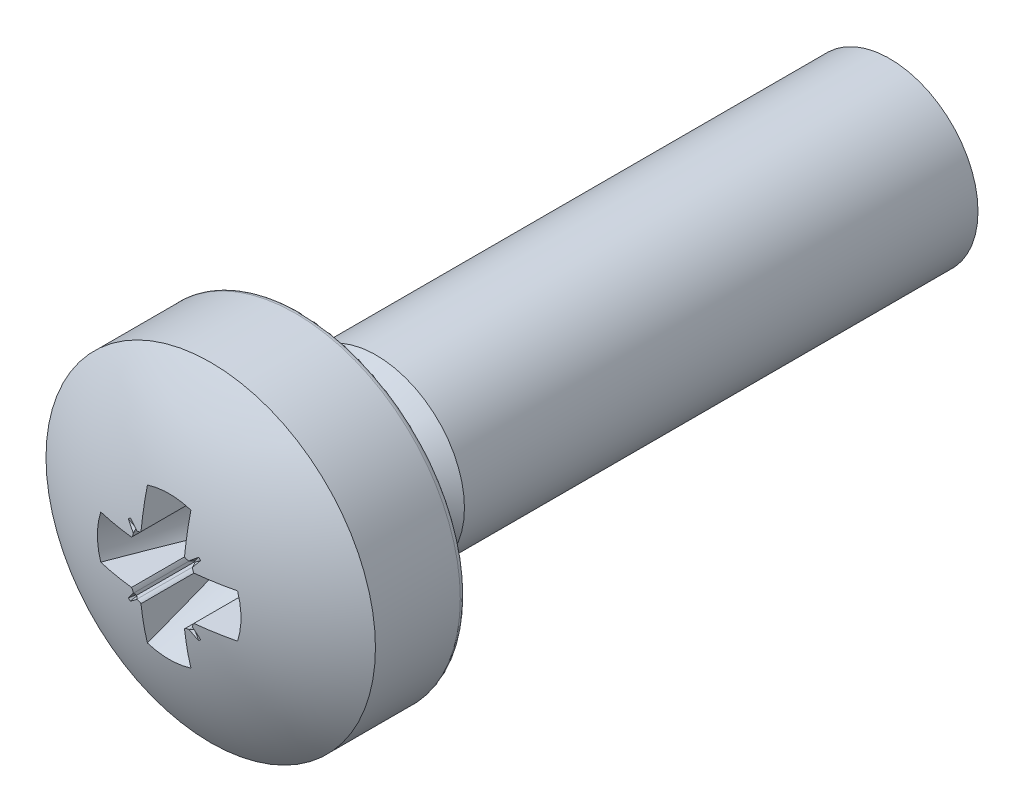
ISO-10303-21;
HEADER;
FILE_DESCRIPTION(('STEP AP214'),'2;1');
FILE_NAME('part.step','',(''),(''),'','','');
FILE_SCHEMA(('AUTOMOTIVE_DESIGN { 1 0 10303 214 1 1 1 1 }'));
ENDSEC;
DATA;
#1=APPLICATION_CONTEXT('core data for automotive mechanical design processes');
#2=APPLICATION_PROTOCOL_DEFINITION('international standard','automotive_design',2000,#1);
#3=PRODUCT_CONTEXT('',#1,'mechanical');
#4=PRODUCT('Part','Part','',(#3));
#5=PRODUCT_RELATED_PRODUCT_CATEGORY('part','',(#4));
#6=PRODUCT_DEFINITION_FORMATION('','',#4);
#7=PRODUCT_DEFINITION_CONTEXT('part definition',#1,'design');
#8=PRODUCT_DEFINITION('design','',#6,#7);
#9=PRODUCT_DEFINITION_SHAPE('','',#8);
#10=(LENGTH_UNIT() NAMED_UNIT(*) SI_UNIT(.MILLI.,.METRE.));
#11=(NAMED_UNIT(*) PLANE_ANGLE_UNIT() SI_UNIT($,.RADIAN.));
#12=(NAMED_UNIT(*) SI_UNIT($,.STERADIAN.) SOLID_ANGLE_UNIT());
#13=UNCERTAINTY_MEASURE_WITH_UNIT(LENGTH_MEASURE(1.E-05),#10,'distance_accuracy_value','');
#14=(GEOMETRIC_REPRESENTATION_CONTEXT(3) GLOBAL_UNCERTAINTY_ASSIGNED_CONTEXT((#13)) GLOBAL_UNIT_ASSIGNED_CONTEXT((#10,
#11,#12)) REPRESENTATION_CONTEXT('',''));
#15=CARTESIAN_POINT('',(0.,0.,0.));
#16=DIRECTION('',(0.,0.,1.));
#17=DIRECTION('',(1.,0.,0.));
#18=AXIS2_PLACEMENT_3D('',#15,#16,#17);
#19=CARTESIAN_POINT('',(0.,0.,-2.6));
#20=DIRECTION('',(1.,0.,0.));
#21=DIRECTION('',(0.,0.,-1.));
#22=AXIS2_PLACEMENT_3D('',#19,#20,#21);
#23=SPHERICAL_SURFACE('',#22,5.);
#24=CARTESIAN_POINT('',(0.37,0.,-2.6));
#25=DIRECTION('',(1.,0.,0.));
#26=DIRECTION('',(0.,0.,-1.));
#27=AXIS2_PLACEMENT_3D('',#24,#25,#26);
#28=CIRCLE('',#27,4.98629120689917);
#29=CARTESIAN_POINT('',(0.37,-0.529627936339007,2.35808372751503));
#30=VERTEX_POINT('',#29);
#31=CARTESIAN_POINT('',(0.37,-1.16318247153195,2.24872215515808));
#32=VERTEX_POINT('',#31);
#33=EDGE_CURVE('E25',#30,#32,#28,.T.);
#34=ORIENTED_EDGE('',*,*,#33,.T.);
#35=CARTESIAN_POINT('',(0.,0.,2.24872215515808));
#36=DIRECTION('',(0.,0.,-1.));
#37=DIRECTION('',(0.,1.,0.));
#38=AXIS2_PLACEMENT_3D('',#35,#36,#37);
#39=CIRCLE('',#38,1.22061192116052);
#40=CARTESIAN_POINT('',(-0.37,-1.16318247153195,2.24872215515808));
#41=VERTEX_POINT('',#40);
#42=EDGE_CURVE('E11',#32,#41,#39,.T.);
#43=ORIENTED_EDGE('',*,*,#42,.T.);
#44=CARTESIAN_POINT('',(-0.37,0.,-2.6));
#45=DIRECTION('',(1.,0.,0.));
#46=DIRECTION('',(0.,-1.,0.));
#47=AXIS2_PLACEMENT_3D('',#44,#45,#46);
#48=CIRCLE('',#47,4.98629120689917);
#49=CARTESIAN_POINT('',(-0.37,-0.529627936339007,2.35808372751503));
#50=VERTEX_POINT('',#49);
#51=EDGE_CURVE('E1353',#50,#41,#48,.T.);
#52=ORIENTED_EDGE('',*,*,#51,.F.);
#53=CARTESIAN_POINT('',(-0.444476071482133,-0.502939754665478,2.35474445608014));
#54=CARTESIAN_POINT('',(-0.437160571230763,-0.503188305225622,2.35537565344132));
#55=CARTESIAN_POINT('',(-0.429859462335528,-0.504068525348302,2.35592475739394));
#56=CARTESIAN_POINT('',(-0.415681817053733,-0.507004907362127,2.3568342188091));
#57=CARTESIAN_POINT('',(-0.408799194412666,-0.509030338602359,2.35719905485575));
#58=CARTESIAN_POINT('',(-0.396448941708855,-0.513805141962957,2.35770811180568));
#59=CARTESIAN_POINT('',(-0.390922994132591,-0.516402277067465,2.35787705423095));
#60=CARTESIAN_POINT('',(-0.380166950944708,-0.522410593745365,2.35808422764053));
#61=CARTESIAN_POINT('',(-0.374946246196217,-0.525838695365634,2.35811944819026));
#62=CARTESIAN_POINT('',(-0.3699998,-0.529628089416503,2.35808372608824));
#63=B_SPLINE_CURVE_WITH_KNOTS('',3,(#53,#54,#55,#56,#57,#58,#59,#60,#61,#62),.UNSPECIFIED.,.F.,
.F.,(4,2,2,2,4),(0.,0.0220151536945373,0.0434658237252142,0.0617299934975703,
0.0804029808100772),.UNSPECIFIED.);
#64=CARTESIAN_POINT('',(-0.441218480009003,-0.503094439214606,2.35501990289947));
#65=VERTEX_POINT('',#64);
#66=EDGE_CURVE('E1275',#65,#50,#63,.T.);
#67=ORIENTED_EDGE('',*,*,#66,.F.);
#68=CARTESIAN_POINT('',(-1.67269810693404,1.67269810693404,-0.784847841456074));
#69=DIRECTION('',(-0.560985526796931,0.560985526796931,0.608761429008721));
#70=DIRECTION('',(0.,-0.735373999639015,0.677661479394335));
#71=AXIS2_PLACEMENT_3D('',#68,#69,#70);
#72=CIRCLE('',#71,4.01364980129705);
#73=CARTESIAN_POINT('',(-0.581462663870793,-0.613988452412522,2.32797314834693));
#74=VERTEX_POINT('',#73);
#75=EDGE_CURVE('E1273',#74,#65,#72,.T.);
#76=ORIENTED_EDGE('',*,*,#75,.F.);
#77=CARTESIAN_POINT('',(0.4748329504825,0.4748329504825,2.11179830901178));
#78=DIRECTION('',(0.0997672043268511,0.0997672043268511,0.989996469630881));
#79=DIRECTION('',(0.994960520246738,0.,-0.10026745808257));
#80=AXIS2_PLACEMENT_3D('',#77,#78,#79);
#81=CIRCLE('',#80,1.53232634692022);
#82=CARTESIAN_POINT('',(-0.613988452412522,-0.581462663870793,2.32797314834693));
#83=VERTEX_POINT('',#82);
#84=EDGE_CURVE('E1252',#83,#74,#81,.T.);
#85=ORIENTED_EDGE('',*,*,#84,.F.);
#86=CARTESIAN_POINT('',(1.67269810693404,-1.67269810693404,-0.784847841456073));
#87=DIRECTION('',(-0.560985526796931,0.560985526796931,-0.608761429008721));
#88=DIRECTION('',(-0.735373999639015,0.,0.677661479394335));
#89=AXIS2_PLACEMENT_3D('',#86,#87,#88);
#90=CIRCLE('',#89,4.01364980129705);
#91=CARTESIAN_POINT('',(-0.503094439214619,-0.441218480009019,2.35501990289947));
#92=VERTEX_POINT('',#91);
#93=EDGE_CURVE('E1182',#83,#92,#90,.T.);
#94=ORIENTED_EDGE('',*,*,#93,.T.);
#95=CARTESIAN_POINT('',(-0.502939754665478,-0.444476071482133,2.35474445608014));
#96=CARTESIAN_POINT('',(-0.503188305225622,-0.437160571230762,2.35537565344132));
#97=CARTESIAN_POINT('',(-0.504068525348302,-0.429859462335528,2.35592475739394));
#98=CARTESIAN_POINT('',(-0.507004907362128,-0.415681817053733,2.3568342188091));
#99=CARTESIAN_POINT('',(-0.50903033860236,-0.408799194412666,2.35719905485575));
#100=CARTESIAN_POINT('',(-0.513805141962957,-0.396448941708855,2.35770811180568));
#101=CARTESIAN_POINT('',(-0.516402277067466,-0.390922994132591,2.35787705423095));
#102=CARTESIAN_POINT('',(-0.522410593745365,-0.380166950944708,2.35808422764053));
#103=CARTESIAN_POINT('',(-0.525838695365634,-0.374946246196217,2.35811944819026));
#104=CARTESIAN_POINT('',(-0.529628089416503,-0.3699998,2.35808372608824));
#105=B_SPLINE_CURVE_WITH_KNOTS('',3,(#95,#96,#97,#98,#99,#100,#101,#102,#103,#104),
.UNSPECIFIED.,.F.,.F.,(4,2,2,2,4),(0.,0.0220151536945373,0.0434658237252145,0.0617299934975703,
0.080402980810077),.UNSPECIFIED.);
#106=CARTESIAN_POINT('',(-0.529627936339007,-0.37,2.35808372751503));
#107=VERTEX_POINT('',#106);
#108=EDGE_CURVE('E1167',#92,#107,#105,.T.);
#109=ORIENTED_EDGE('',*,*,#108,.T.);
#110=CARTESIAN_POINT('',(0.,-0.37,-2.6));
#111=DIRECTION('',(0.,1.,0.));
#112=DIRECTION('',(0.,0.,1.));
#113=AXIS2_PLACEMENT_3D('',#110,#111,#112);
#114=CIRCLE('',#113,4.98629120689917);
#115=CARTESIAN_POINT('',(-1.16318247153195,-0.37,2.24872215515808));
#116=VERTEX_POINT('',#115);
#117=EDGE_CURVE('E1175',#116,#107,#114,.T.);
#118=ORIENTED_EDGE('',*,*,#117,.F.);
#119=CARTESIAN_POINT('',(0.,0.,2.24872215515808));
#120=DIRECTION('',(0.,0.,-1.));
#121=DIRECTION('',(0.,1.,0.));
#122=AXIS2_PLACEMENT_3D('',#119,#120,#121);
#123=CIRCLE('',#122,1.22061192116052);
#124=CARTESIAN_POINT('',(-1.16318247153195,0.37,2.24872215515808));
#125=VERTEX_POINT('',#124);
#126=EDGE_CURVE('E1242',#116,#125,#123,.T.);
#127=ORIENTED_EDGE('',*,*,#126,.T.);
#128=CARTESIAN_POINT('',(0.,0.37,-2.6));
#129=DIRECTION('',(0.,1.,0.));
#130=DIRECTION('',(0.,0.,1.));
#131=AXIS2_PLACEMENT_3D('',#128,#129,#130);
#132=CIRCLE('',#131,4.98629120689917);
#133=CARTESIAN_POINT('',(-0.529627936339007,0.37,2.35808372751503));
#134=VERTEX_POINT('',#133);
#135=EDGE_CURVE('E974',#125,#134,#132,.T.);
#136=ORIENTED_EDGE('',*,*,#135,.T.);
#137=CARTESIAN_POINT('',(-0.502939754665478,0.444476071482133,2.35474445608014));
#138=CARTESIAN_POINT('',(-0.503188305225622,0.437160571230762,2.35537565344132));
#139=CARTESIAN_POINT('',(-0.504068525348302,0.429859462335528,2.35592475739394));
#140=CARTESIAN_POINT('',(-0.507004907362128,0.415681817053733,2.3568342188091));
#141=CARTESIAN_POINT('',(-0.50903033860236,0.408799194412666,2.35719905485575));
#142=CARTESIAN_POINT('',(-0.513805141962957,0.396448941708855,2.35770811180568));
#143=CARTESIAN_POINT('',(-0.516402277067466,0.390922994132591,2.35787705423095));
#144=CARTESIAN_POINT('',(-0.522410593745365,0.380166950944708,2.35808422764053));
#145=CARTESIAN_POINT('',(-0.525838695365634,0.374946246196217,2.35811944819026));
#146=CARTESIAN_POINT('',(-0.529628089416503,0.3699998,2.35808372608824));
#147=B_SPLINE_CURVE_WITH_KNOTS('',3,(#137,#138,#139,#140,#141,#142,#143,#144,#145,#146),
.UNSPECIFIED.,.F.,.F.,(4,2,2,2,4),(0.,0.0220151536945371,0.043465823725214,0.0617299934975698,
0.0804029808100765),.UNSPECIFIED.);
#148=CARTESIAN_POINT('',(-0.50309443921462,0.44121848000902,2.35501990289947));
#149=VERTEX_POINT('',#148);
#150=EDGE_CURVE('E40',#149,#134,#147,.T.);
#151=ORIENTED_EDGE('',*,*,#150,.F.);
#152=CARTESIAN_POINT('',(1.67269810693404,1.67269810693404,-0.784847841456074));
#153=DIRECTION('',(0.560985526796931,0.560985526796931,0.608761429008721));
#154=DIRECTION('',(0.735373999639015,0.,-0.677661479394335));
#155=AXIS2_PLACEMENT_3D('',#152,#153,#154);
#156=CIRCLE('',#155,4.01364980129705);
#157=CARTESIAN_POINT('',(-0.613988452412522,0.581462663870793,2.32797314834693));
#158=VERTEX_POINT('',#157);
#159=EDGE_CURVE('E360',#158,#149,#156,.T.);
#160=ORIENTED_EDGE('',*,*,#159,.F.);
#161=CARTESIAN_POINT('',(0.4748329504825,-0.4748329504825,2.11179830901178));
#162=DIRECTION('',(0.099767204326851,-0.099767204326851,0.989996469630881));
#163=DIRECTION('',(0.994960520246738,0.,-0.10026745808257));
#164=AXIS2_PLACEMENT_3D('',#161,#162,#163);
#165=CIRCLE('',#164,1.53232634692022);
#166=CARTESIAN_POINT('',(-0.581462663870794,0.613988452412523,2.32797314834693));
#167=VERTEX_POINT('',#166);
#168=EDGE_CURVE('E308',#167,#158,#165,.T.);
#169=ORIENTED_EDGE('',*,*,#168,.F.);
#170=CARTESIAN_POINT('',(-1.67269810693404,-1.67269810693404,-0.784847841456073));
#171=DIRECTION('',(0.560985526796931,0.560985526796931,-0.608761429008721));
#172=DIRECTION('',(-0.735373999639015,0.,-0.677661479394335));
#173=AXIS2_PLACEMENT_3D('',#170,#171,#172);
#174=CIRCLE('',#173,4.01364980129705);
#175=CARTESIAN_POINT('',(-0.441218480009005,0.503094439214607,2.35501990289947));
#176=VERTEX_POINT('',#175);
#177=EDGE_CURVE('E363',#167,#176,#174,.T.);
#178=ORIENTED_EDGE('',*,*,#177,.T.);
#179=CARTESIAN_POINT('',(-0.444476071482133,0.502939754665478,2.35474445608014));
#180=CARTESIAN_POINT('',(-0.437160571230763,0.503188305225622,2.35537565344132));
#181=CARTESIAN_POINT('',(-0.429859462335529,0.504068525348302,2.35592475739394));
#182=CARTESIAN_POINT('',(-0.415681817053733,0.507004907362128,2.3568342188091));
#183=CARTESIAN_POINT('',(-0.408799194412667,0.50903033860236,2.35719905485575));
#184=CARTESIAN_POINT('',(-0.396448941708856,0.513805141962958,2.35770811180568));
#185=CARTESIAN_POINT('',(-0.390922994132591,0.516402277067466,2.35787705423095));
#186=CARTESIAN_POINT('',(-0.380166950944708,0.522410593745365,2.35808422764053));
#187=CARTESIAN_POINT('',(-0.374946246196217,0.525838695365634,2.35811944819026));
#188=CARTESIAN_POINT('',(-0.3699998,0.529628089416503,2.35808372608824));
#189=B_SPLINE_CURVE_WITH_KNOTS('',3,(#179,#180,#181,#182,#183,#184,#185,#186,#187,#188),
.UNSPECIFIED.,.F.,.F.,(4,2,2,2,4),(0.,0.0220151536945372,0.043465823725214,0.0617299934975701,
0.0804029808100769),.UNSPECIFIED.);
#190=CARTESIAN_POINT('',(-0.37,0.529627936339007,2.35808372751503));
#191=VERTEX_POINT('',#190);
#192=EDGE_CURVE('E366',#176,#191,#189,.T.);
#193=ORIENTED_EDGE('',*,*,#192,.T.);
#194=CARTESIAN_POINT('',(-0.37,0.,-2.6));
#195=DIRECTION('',(1.,0.,0.));
#196=DIRECTION('',(0.,0.,-1.));
#197=AXIS2_PLACEMENT_3D('',#194,#195,#196);
#198=CIRCLE('',#197,4.98629120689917);
#199=CARTESIAN_POINT('',(-0.37,1.16318247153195,2.24872215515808));
#200=VERTEX_POINT('',#199);
#201=EDGE_CURVE('E373',#200,#191,#198,.T.);
#202=ORIENTED_EDGE('',*,*,#201,.F.);
#203=CARTESIAN_POINT('',(0.,0.,2.24872215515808));
#204=DIRECTION('',(0.,0.,-1.));
#205=DIRECTION('',(0.,1.,0.));
#206=AXIS2_PLACEMENT_3D('',#203,#204,#205);
#207=CIRCLE('',#206,1.22061192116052);
#208=CARTESIAN_POINT('',(0.37,1.16318247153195,2.24872215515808));
#209=VERTEX_POINT('',#208);
#210=EDGE_CURVE('E1314',#200,#209,#207,.T.);
#211=ORIENTED_EDGE('',*,*,#210,.T.);
#212=CARTESIAN_POINT('',(0.37,0.,-2.6));
#213=DIRECTION('',(1.,0.,0.));
#214=DIRECTION('',(0.,0.,-1.));
#215=AXIS2_PLACEMENT_3D('',#212,#213,#214);
#216=CIRCLE('',#215,4.98629120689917);
#217=CARTESIAN_POINT('',(0.37,0.529627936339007,2.35808372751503));
#218=VERTEX_POINT('',#217);
#219=EDGE_CURVE('E1232',#209,#218,#216,.T.);
#220=ORIENTED_EDGE('',*,*,#219,.T.);
#221=CARTESIAN_POINT('',(0.444476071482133,0.502939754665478,2.35474445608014));
#222=CARTESIAN_POINT('',(0.437160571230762,0.503188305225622,2.35537565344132));
#223=CARTESIAN_POINT('',(0.429859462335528,0.504068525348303,2.35592475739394));
#224=CARTESIAN_POINT('',(0.415681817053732,0.507004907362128,2.3568342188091));
#225=CARTESIAN_POINT('',(0.408799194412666,0.50903033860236,2.35719905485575));
#226=CARTESIAN_POINT('',(0.396448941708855,0.513805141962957,2.35770811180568));
#227=CARTESIAN_POINT('',(0.390922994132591,0.516402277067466,2.35787705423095));
#228=CARTESIAN_POINT('',(0.380166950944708,0.522410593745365,2.35808422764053));
#229=CARTESIAN_POINT('',(0.374946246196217,0.525838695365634,2.35811944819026));
#230=CARTESIAN_POINT('',(0.3699998,0.529628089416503,2.35808372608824));
#231=B_SPLINE_CURVE_WITH_KNOTS('',3,(#221,#222,#223,#224,#225,#226,#227,#228,#229,#230),
.UNSPECIFIED.,.F.,.F.,(4,2,2,2,4),(0.,0.0220151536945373,0.0434658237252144,0.0617299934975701,
0.0804029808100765),.UNSPECIFIED.);
#232=CARTESIAN_POINT('',(0.441218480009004,0.503094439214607,2.35501990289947));
#233=VERTEX_POINT('',#232);
#234=EDGE_CURVE('E1226',#233,#218,#231,.T.);
#235=ORIENTED_EDGE('',*,*,#234,.F.);
#236=CARTESIAN_POINT('',(1.67269810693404,-1.67269810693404,-0.784847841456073));
#237=DIRECTION('',(0.560985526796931,-0.560985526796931,0.608761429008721));
#238=DIRECTION('',(0.,-0.735373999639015,-0.677661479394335));
#239=AXIS2_PLACEMENT_3D('',#236,#237,#238);
#240=CIRCLE('',#239,4.01364980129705);
#241=CARTESIAN_POINT('',(0.581462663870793,0.613988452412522,2.32797314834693));
#242=VERTEX_POINT('',#241);
#243=EDGE_CURVE('E1238',#242,#233,#240,.T.);
#244=ORIENTED_EDGE('',*,*,#243,.F.);
#245=CARTESIAN_POINT('',(-0.4748329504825,-0.474832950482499,2.11179830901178));
#246=DIRECTION('',(-0.0997672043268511,-0.0997672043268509,0.989996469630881));
#247=DIRECTION('',(0.994960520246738,0.,0.10026745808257));
#248=AXIS2_PLACEMENT_3D('',#245,#246,#247);
#249=CIRCLE('',#248,1.53232634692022);
#250=CARTESIAN_POINT('',(0.613988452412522,0.581462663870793,2.32797314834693));
#251=VERTEX_POINT('',#250);
#252=EDGE_CURVE('E1240',#251,#242,#249,.T.);
#253=ORIENTED_EDGE('',*,*,#252,.F.);
#254=CARTESIAN_POINT('',(-1.67269810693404,1.67269810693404,-0.784847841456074));
#255=DIRECTION('',(0.560985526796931,-0.560985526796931,-0.608761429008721));
#256=DIRECTION('',(0.,0.735373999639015,-0.677661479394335));
#257=AXIS2_PLACEMENT_3D('',#254,#255,#256);
#258=CIRCLE('',#257,4.01364980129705);
#259=CARTESIAN_POINT('',(0.503094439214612,0.44121848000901,2.35501990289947));
#260=VERTEX_POINT('',#259);
#261=EDGE_CURVE('E1243',#251,#260,#258,.T.);
#262=ORIENTED_EDGE('',*,*,#261,.T.);
#263=CARTESIAN_POINT('',(0.502939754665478,0.444476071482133,2.35474445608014));
#264=CARTESIAN_POINT('',(0.503188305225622,0.437160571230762,2.35537565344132));
#265=CARTESIAN_POINT('',(0.504068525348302,0.429859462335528,2.35592475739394));
#266=CARTESIAN_POINT('',(0.507004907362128,0.415681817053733,2.3568342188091));
#267=CARTESIAN_POINT('',(0.50903033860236,0.408799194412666,2.35719905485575));
#268=CARTESIAN_POINT('',(0.513805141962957,0.396448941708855,2.35770811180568));
#269=CARTESIAN_POINT('',(0.516402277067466,0.390922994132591,2.35787705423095));
#270=CARTESIAN_POINT('',(0.522410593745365,0.380166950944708,2.35808422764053));
#271=CARTESIAN_POINT('',(0.525838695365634,0.374946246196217,2.35811944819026));
#272=CARTESIAN_POINT('',(0.529628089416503,0.3699998,2.35808372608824));
#273=B_SPLINE_CURVE_WITH_KNOTS('',3,(#263,#264,#265,#266,#267,#268,#269,#270,#271,#272),
.UNSPECIFIED.,.F.,.F.,(4,2,2,2,4),(0.,0.0220151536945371,0.043465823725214,0.0617299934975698,
0.0804029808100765),.UNSPECIFIED.);
#274=CARTESIAN_POINT('',(0.529627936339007,0.37,2.35808372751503));
#275=VERTEX_POINT('',#274);
#276=EDGE_CURVE('E1174',#260,#275,#273,.T.);
#277=ORIENTED_EDGE('',*,*,#276,.T.);
#278=CARTESIAN_POINT('',(0.,0.37,-2.6));
#279=DIRECTION('',(0.,1.,0.));
#280=DIRECTION('',(0.,0.,1.));
#281=AXIS2_PLACEMENT_3D('',#278,#279,#280);
#282=CIRCLE('',#281,4.98629120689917);
#283=CARTESIAN_POINT('',(1.16318247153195,0.37,2.24872215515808));
#284=VERTEX_POINT('',#283);
#285=EDGE_CURVE('E1254',#275,#284,#282,.T.);
#286=ORIENTED_EDGE('',*,*,#285,.T.);
#287=CARTESIAN_POINT('',(0.,0.,2.24872215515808));
#288=DIRECTION('',(0.,0.,-1.));
#289=DIRECTION('',(0.,1.,0.));
#290=AXIS2_PLACEMENT_3D('',#287,#288,#289);
#291=CIRCLE('',#290,1.22061192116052);
#292=CARTESIAN_POINT('',(1.16318247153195,-0.37,2.24872215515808));
#293=VERTEX_POINT('',#292);
#294=EDGE_CURVE('E1256',#284,#293,#291,.T.);
#295=ORIENTED_EDGE('',*,*,#294,.T.);
#296=CARTESIAN_POINT('',(0.,-0.37,-2.6));
#297=DIRECTION('',(0.,1.,0.));
#298=DIRECTION('',(0.,0.,1.));
#299=AXIS2_PLACEMENT_3D('',#296,#297,#298);
#300=CIRCLE('',#299,4.98629120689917);
#301=CARTESIAN_POINT('',(0.529627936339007,-0.37,2.35808372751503));
#302=VERTEX_POINT('',#301);
#303=EDGE_CURVE('E1258',#302,#293,#300,.T.);
#304=ORIENTED_EDGE('',*,*,#303,.F.);
#305=CARTESIAN_POINT('',(0.502939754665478,-0.444476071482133,2.35474445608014));
#306=CARTESIAN_POINT('',(0.503188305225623,-0.437160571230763,2.35537565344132));
#307=CARTESIAN_POINT('',(0.504068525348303,-0.429859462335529,2.35592475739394));
#308=CARTESIAN_POINT('',(0.507004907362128,-0.415681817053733,2.3568342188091));
#309=CARTESIAN_POINT('',(0.509030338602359,-0.408799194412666,2.35719905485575));
#310=CARTESIAN_POINT('',(0.513805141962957,-0.396448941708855,2.35770811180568));
#311=CARTESIAN_POINT('',(0.516402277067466,-0.390922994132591,2.35787705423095));
#312=CARTESIAN_POINT('',(0.522410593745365,-0.380166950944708,2.35808422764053));
#313=CARTESIAN_POINT('',(0.525838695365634,-0.374946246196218,2.35811944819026));
#314=CARTESIAN_POINT('',(0.529628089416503,-0.3699998,2.35808372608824));
#315=B_SPLINE_CURVE_WITH_KNOTS('',3,(#305,#306,#307,#308,#309,#310,#311,#312,#313,#314),
.UNSPECIFIED.,.F.,.F.,(4,2,2,2,4),(0.,0.0220151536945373,0.0434658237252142,0.0617299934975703,
0.0804029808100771),.UNSPECIFIED.);
#316=CARTESIAN_POINT('',(0.503094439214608,-0.441218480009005,2.35501990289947));
#317=VERTEX_POINT('',#316);
#318=EDGE_CURVE('E1262',#317,#302,#315,.T.);
#319=ORIENTED_EDGE('',*,*,#318,.F.);
#320=CARTESIAN_POINT('',(-1.67269810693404,-1.67269810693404,-0.784847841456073));
#321=DIRECTION('',(-0.560985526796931,-0.560985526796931,0.608761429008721));
#322=DIRECTION('',(0.735373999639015,0.,0.677661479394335));
#323=AXIS2_PLACEMENT_3D('',#320,#321,#322);
#324=CIRCLE('',#323,4.01364980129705);
#325=CARTESIAN_POINT('',(0.613988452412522,-0.581462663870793,2.32797314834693));
#326=VERTEX_POINT('',#325);
#327=EDGE_CURVE('E1267',#326,#317,#324,.T.);
#328=ORIENTED_EDGE('',*,*,#327,.F.);
#329=CARTESIAN_POINT('',(-0.474832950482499,0.474832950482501,2.11179830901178));
#330=DIRECTION('',(-0.099767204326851,0.0997672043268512,0.989996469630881));
#331=DIRECTION('',(0.,-0.994960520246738,0.10026745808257));
#332=AXIS2_PLACEMENT_3D('',#329,#330,#331);
#333=CIRCLE('',#332,1.53232634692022);
#334=CARTESIAN_POINT('',(0.581462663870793,-0.613988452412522,2.32797314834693));
#335=VERTEX_POINT('',#334);
#336=EDGE_CURVE('E1280',#335,#326,#333,.T.);
#337=ORIENTED_EDGE('',*,*,#336,.F.);
#338=CARTESIAN_POINT('',(1.67269810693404,1.67269810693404,-0.784847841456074));
#339=DIRECTION('',(-0.560985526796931,-0.560985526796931,-0.608761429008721));
#340=DIRECTION('',(0.,0.735373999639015,-0.677661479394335));
#341=AXIS2_PLACEMENT_3D('',#338,#339,#340);
#342=CIRCLE('',#341,4.01364980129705);
#343=CARTESIAN_POINT('',(0.441218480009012,-0.503094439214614,2.35501990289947));
#344=VERTEX_POINT('',#343);
#345=EDGE_CURVE('E1356',#335,#344,#342,.T.);
#346=ORIENTED_EDGE('',*,*,#345,.T.);
#347=CARTESIAN_POINT('',(0.444476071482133,-0.502939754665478,2.35474445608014));
#348=CARTESIAN_POINT('',(0.437160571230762,-0.503188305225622,2.35537565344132));
#349=CARTESIAN_POINT('',(0.429859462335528,-0.504068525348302,2.35592475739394));
#350=CARTESIAN_POINT('',(0.415681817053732,-0.507004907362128,2.3568342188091));
#351=CARTESIAN_POINT('',(0.408799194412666,-0.50903033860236,2.35719905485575));
#352=CARTESIAN_POINT('',(0.396448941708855,-0.513805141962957,2.35770811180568));
#353=CARTESIAN_POINT('',(0.390922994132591,-0.516402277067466,2.35787705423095));
#354=CARTESIAN_POINT('',(0.380166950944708,-0.522410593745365,2.35808422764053));
#355=CARTESIAN_POINT('',(0.374946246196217,-0.525838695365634,2.35811944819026));
#356=CARTESIAN_POINT('',(0.3699998,-0.529628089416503,2.35808372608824));
#357=B_SPLINE_CURVE_WITH_KNOTS('',3,(#347,#348,#349,#350,#351,#352,#353,#354,#355,#356),
.UNSPECIFIED.,.F.,.F.,(4,2,2,2,4),(0.,0.0220151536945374,0.0434658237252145,0.0617299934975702,
0.0804029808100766),.UNSPECIFIED.);
#358=EDGE_CURVE('E1354',#344,#30,#357,.T.);
#359=ORIENTED_EDGE('',*,*,#358,.T.);
#360=EDGE_LOOP('',(#34,#43,#52,#67,#76,#85,#94,#109,#118,#127,#136,#151,#160,#169,#178,#193,
#202,#211,#220,#235,#244,#253,#262,#277,#286,#295,#304,#319,#328,#337,#346,#359));
#361=FACE_BOUND('',#360,.T.);
#362=CARTESIAN_POINT('',(0.,0.,1.54246303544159));
#363=DIRECTION('',(0.,0.,1.));
#364=DIRECTION('',(1.,0.,0.));
#365=AXIS2_PLACEMENT_3D('',#362,#363,#364);
#366=CIRCLE('',#365,2.8);
#367=CARTESIAN_POINT('',(2.8,0.,1.5424630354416));
#368=VERTEX_POINT('',#367);
#369=EDGE_CURVE('E327',#368,#368,#366,.T.);
#370=ORIENTED_EDGE('',*,*,#369,.T.);
#371=EDGE_LOOP('',(#370));
#372=FACE_BOUND('',#371,.T.);
#373=ADVANCED_FACE('F17',(#361,#372),#23,.T.);
#374=CARTESIAN_POINT('',(0.,0.,-10.));
#375=DIRECTION('',(0.,0.,1.));
#376=DIRECTION('',(1.,0.,0.));
#377=AXIS2_PLACEMENT_3D('',#374,#375,#376);
#378=PLANE('',#377);
#379=CARTESIAN_POINT('',(0.,0.,-10.));
#380=DIRECTION('',(0.,0.,1.));
#381=DIRECTION('',(1.,0.,0.));
#382=AXIS2_PLACEMENT_3D('',#379,#380,#381);
#383=CIRCLE('',#382,1.5);
#384=CARTESIAN_POINT('',(1.5,0.,-10.));
#385=VERTEX_POINT('',#384);
#386=EDGE_CURVE('E357',#385,#385,#383,.T.);
#387=ORIENTED_EDGE('',*,*,#386,.F.);
#388=EDGE_LOOP('',(#387));
#389=FACE_BOUND('',#388,.T.);
#390=ADVANCED_FACE('F569',(#389),#378,.F.);
#391=CARTESIAN_POINT('',(0.,0.,0.));
#392=DIRECTION('',(0.,0.,1.));
#393=DIRECTION('',(1.,0.,0.));
#394=AXIS2_PLACEMENT_3D('',#391,#392,#393);
#395=CYLINDRICAL_SURFACE('',#394,1.5);
#396=CARTESIAN_POINT('',(0.,0.,-1.270625));
#397=DIRECTION('',(0.,0.,1.));
#398=DIRECTION('',(1.,0.,0.));
#399=AXIS2_PLACEMENT_3D('',#396,#397,#398);
#400=CIRCLE('',#399,1.5);
#401=CARTESIAN_POINT('',(1.5,0.,-1.270625));
#402=VERTEX_POINT('',#401);
#403=EDGE_CURVE('E354',#402,#402,#400,.T.);
#404=ORIENTED_EDGE('',*,*,#403,.F.);
#405=EDGE_LOOP('',(#404));
#406=FACE_BOUND('',#405,.T.);
#407=ORIENTED_EDGE('',*,*,#386,.T.);
#408=EDGE_LOOP('',(#407));
#409=FACE_BOUND('',#408,.T.);
#410=ADVANCED_FACE('F574',(#406,#409),#395,.T.);
#411=CARTESIAN_POINT('',(0.,0.,-1.270625));
#412=DIRECTION('',(0.,0.,-1.));
#413=DIRECTION('',(-1.,0.,0.));
#414=AXIS2_PLACEMENT_3D('',#411,#412,#413);
#415=CONICAL_SURFACE('',#414,1.5,0.785398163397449);
#416=CARTESIAN_POINT('',(0.,0.,-1.));
#417=DIRECTION('',(0.,0.,1.));
#418=DIRECTION('',(1.,0.,0.));
#419=AXIS2_PLACEMENT_3D('',#416,#417,#418);
#420=CIRCLE('',#419,1.229375);
#421=CARTESIAN_POINT('',(1.229375,0.,-1.));
#422=VERTEX_POINT('',#421);
#423=EDGE_CURVE('E351',#422,#422,#420,.T.);
#424=ORIENTED_EDGE('',*,*,#423,.F.);
#425=EDGE_LOOP('',(#424));
#426=FACE_BOUND('',#425,.T.);
#427=ORIENTED_EDGE('',*,*,#403,.T.);
#428=EDGE_LOOP('',(#427));
#429=FACE_BOUND('',#428,.T.);
#430=ADVANCED_FACE('F615',(#426,#429),#415,.T.);
#431=CARTESIAN_POINT('',(0.,0.,0.));
#432=DIRECTION('',(0.,0.,1.));
#433=DIRECTION('',(1.,0.,0.));
#434=AXIS2_PLACEMENT_3D('',#431,#432,#433);
#435=CYLINDRICAL_SURFACE('',#434,1.229375);
#436=CARTESIAN_POINT('',(0.,0.,-0.9));
#437=DIRECTION('',(0.,0.,1.));
#438=DIRECTION('',(1.,0.,0.));
#439=AXIS2_PLACEMENT_3D('',#436,#437,#438);
#440=CIRCLE('',#439,1.229375);
#441=CARTESIAN_POINT('',(1.229375,0.,-0.9));
#442=VERTEX_POINT('',#441);
#443=EDGE_CURVE('E348',#442,#442,#440,.T.);
#444=ORIENTED_EDGE('',*,*,#443,.F.);
#445=EDGE_LOOP('',(#444));
#446=FACE_BOUND('',#445,.T.);
#447=ORIENTED_EDGE('',*,*,#423,.T.);
#448=EDGE_LOOP('',(#447));
#449=FACE_BOUND('',#448,.T.);
#450=ADVANCED_FACE('F611',(#446,#449),#435,.T.);
#451=CARTESIAN_POINT('',(0.,0.,-0.9));
#452=DIRECTION('',(0.,0.,1.));
#453=DIRECTION('',(1.,0.,0.));
#454=AXIS2_PLACEMENT_3D('',#451,#452,#453);
#455=TOROIDAL_SURFACE('',#454,1.329375,0.1);
#456=ORIENTED_EDGE('',*,*,#443,.T.);
#457=EDGE_LOOP('',(#456));
#458=FACE_BOUND('',#457,.T.);
#459=CARTESIAN_POINT('',(0.,0.,-0.838704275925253));
#460=DIRECTION('',(0.,0.,1.));
#461=DIRECTION('',(1.,0.,0.));
#462=AXIS2_PLACEMENT_3D('',#459,#460,#461);
#463=CIRCLE('',#462,1.25036339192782);
#464=CARTESIAN_POINT('',(1.25036339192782,0.,-0.838704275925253));
#465=VERTEX_POINT('',#464);
#466=EDGE_CURVE('E345',#465,#465,#463,.T.);
#467=ORIENTED_EDGE('',*,*,#466,.F.);
#468=EDGE_LOOP('',(#467));
#469=FACE_BOUND('',#468,.T.);
#470=ADVANCED_FACE('F605',(#458,#469),#455,.F.);
#471=CARTESIAN_POINT('',(0.,0.,-0.838704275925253));
#472=DIRECTION('',(0.,0.,1.));
#473=DIRECTION('',(1.,0.,0.));
#474=AXIS2_PLACEMENT_3D('',#471,#472,#473);
#475=CONICAL_SURFACE('',#474,1.25036339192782,0.659797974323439);
#476=CARTESIAN_POINT('',(0.,0.,-0.0387042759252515));
#477=DIRECTION('',(0.,0.,1.));
#478=DIRECTION('',(1.,0.,0.));
#479=AXIS2_PLACEMENT_3D('',#476,#477,#478);
#480=CIRCLE('',#479,1.87098839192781);
#481=CARTESIAN_POINT('',(1.87098839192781,0.,-0.0387042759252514));
#482=VERTEX_POINT('',#481);
#483=EDGE_CURVE('E342',#482,#482,#480,.T.);
#484=ORIENTED_EDGE('',*,*,#483,.F.);
#485=EDGE_LOOP('',(#484));
#486=FACE_BOUND('',#485,.T.);
#487=ORIENTED_EDGE('',*,*,#466,.T.);
#488=EDGE_LOOP('',(#487));
#489=FACE_BOUND('',#488,.T.);
#490=ADVANCED_FACE('F599',(#486,#489),#475,.T.);
#491=CARTESIAN_POINT('',(0.,0.,-0.1));
#492=DIRECTION('',(0.,0.,1.));
#493=DIRECTION('',(1.,0.,0.));
#494=AXIS2_PLACEMENT_3D('',#491,#492,#493);
#495=TOROIDAL_SURFACE('',#494,1.95,0.1);
#496=ORIENTED_EDGE('',*,*,#483,.T.);
#497=EDGE_LOOP('',(#496));
#498=FACE_BOUND('',#497,.T.);
#499=CARTESIAN_POINT('',(0.,0.,0.));
#500=DIRECTION('',(0.,0.,1.));
#501=DIRECTION('',(1.,0.,0.));
#502=AXIS2_PLACEMENT_3D('',#499,#500,#501);
#503=CIRCLE('',#502,1.95);
#504=CARTESIAN_POINT('',(1.95,0.,0.));
#505=VERTEX_POINT('',#504);
#506=EDGE_CURVE('E339',#505,#505,#503,.T.);
#507=ORIENTED_EDGE('',*,*,#506,.F.);
#508=EDGE_LOOP('',(#507));
#509=FACE_BOUND('',#508,.T.);
#510=ADVANCED_FACE('F594',(#498,#509),#495,.F.);
#511=CARTESIAN_POINT('',(0.,1.95,0.));
#512=DIRECTION('',(0.,0.,1.));
#513=DIRECTION('',(1.,0.,0.));
#514=AXIS2_PLACEMENT_3D('',#511,#512,#513);
#515=PLANE('',#514);
#516=CARTESIAN_POINT('',(0.,0.,0.));
#517=DIRECTION('',(0.,0.,1.));
#518=DIRECTION('',(1.,0.,0.));
#519=AXIS2_PLACEMENT_3D('',#516,#517,#518);
#520=CIRCLE('',#519,2.7);
#521=CARTESIAN_POINT('',(2.7,0.,0.));
#522=VERTEX_POINT('',#521);
#523=EDGE_CURVE('E336',#522,#522,#520,.T.);
#524=ORIENTED_EDGE('',*,*,#523,.F.);
#525=EDGE_LOOP('',(#524));
#526=FACE_BOUND('',#525,.T.);
#527=ORIENTED_EDGE('',*,*,#506,.T.);
#528=EDGE_LOOP('',(#527));
#529=FACE_BOUND('',#528,.T.);
#530=ADVANCED_FACE('F589',(#526,#529),#515,.F.);
#531=CARTESIAN_POINT('',(0.,0.,0.1));
#532=DIRECTION('',(0.,0.,1.));
#533=DIRECTION('',(1.,0.,0.));
#534=AXIS2_PLACEMENT_3D('',#531,#532,#533);
#535=TOROIDAL_SURFACE('',#534,2.7,0.1);
#536=CARTESIAN_POINT('',(0.,0.,0.1));
#537=DIRECTION('',(0.,0.,1.));
#538=DIRECTION('',(1.,0.,0.));
#539=AXIS2_PLACEMENT_3D('',#536,#537,#538);
#540=CIRCLE('',#539,2.8);
#541=CARTESIAN_POINT('',(2.8,0.,0.1));
#542=VERTEX_POINT('',#541);
#543=EDGE_CURVE('E333',#542,#542,#540,.T.);
#544=ORIENTED_EDGE('',*,*,#543,.F.);
#545=EDGE_LOOP('',(#544));
#546=FACE_BOUND('',#545,.T.);
#547=ORIENTED_EDGE('',*,*,#523,.T.);
#548=EDGE_LOOP('',(#547));
#549=FACE_BOUND('',#548,.T.);
#550=ADVANCED_FACE('F584',(#546,#549),#535,.T.);
#551=CARTESIAN_POINT('',(0.,0.,0.));
#552=DIRECTION('',(0.,0.,1.));
#553=DIRECTION('',(1.,0.,0.));
#554=AXIS2_PLACEMENT_3D('',#551,#552,#553);
#555=CYLINDRICAL_SURFACE('',#554,2.8);
#556=ORIENTED_EDGE('',*,*,#369,.F.);
#557=EDGE_LOOP('',(#556));
#558=FACE_BOUND('',#557,.T.);
#559=ORIENTED_EDGE('',*,*,#543,.T.);
#560=EDGE_LOOP('',(#559));
#561=FACE_BOUND('',#560,.T.);
#562=ADVANCED_FACE('F429',(#558,#561),#555,.T.);
#563=CARTESIAN_POINT('',(-0.37,0.37,0.347071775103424));
#564=DIRECTION('',(0.,1.,0.));
#565=DIRECTION('',(1.,0.,0.));
#566=AXIS2_PLACEMENT_3D('',#563,#564,#565);
#567=PLANE('',#566);
#568=CARTESIAN_POINT('',(-0.313793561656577,0.37,0.214331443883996));
#569=CARTESIAN_POINT('',(-0.329674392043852,0.37,0.242797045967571));
#570=CARTESIAN_POINT('',(-0.345062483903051,0.37,0.271528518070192));
#571=CARTESIAN_POINT('',(-0.375066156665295,0.37,0.329383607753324));
#572=CARTESIAN_POINT('',(-0.389681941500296,0.37,0.358507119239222));
#573=CARTESIAN_POINT('',(-0.418353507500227,0.37,0.417004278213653));
#574=CARTESIAN_POINT('',(-0.432409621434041,0.37,0.446377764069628));
#575=CARTESIAN_POINT('',(-0.460093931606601,0.37,0.505328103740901));
#576=CARTESIAN_POINT('',(-0.473722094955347,0.37,0.534904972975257));
#577=CARTESIAN_POINT('',(-0.5140815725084,0.37,0.623804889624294));
#578=CARTESIAN_POINT('',(-0.540314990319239,0.37,0.683353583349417));
#579=CARTESIAN_POINT('',(-0.591913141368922,0.37,0.802836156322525));
#580=CARTESIAN_POINT('',(-0.61727771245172,0.37,0.862770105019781));
#581=CARTESIAN_POINT('',(-0.677835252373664,0.37,1.00791399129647));
#582=CARTESIAN_POINT('',(-0.712720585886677,0.37,1.09325207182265));
#583=CARTESIAN_POINT('',(-0.781694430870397,0.37,1.26424145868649));
#584=CARTESIAN_POINT('',(-0.815782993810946,0.37,1.34989274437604));
#585=CARTESIAN_POINT('',(-0.917285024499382,0.37,1.607283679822));
#586=CARTESIAN_POINT('',(-0.983886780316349,0.37,1.77934291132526));
#587=CARTESIAN_POINT('',(-1.12569595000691,0.37,2.14933579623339));
#588=CARTESIAN_POINT('',(-1.20072190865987,0.37,2.34733853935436));
#589=CARTESIAN_POINT('',(-1.34990776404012,0.37,2.74366988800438));
#590=CARTESIAN_POINT('',(-1.4240676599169,0.37,2.94199849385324));
#591=CARTESIAN_POINT('',(-1.57171815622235,0.37,3.33850012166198));
#592=CARTESIAN_POINT('',(-1.64520971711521,0.37,3.53667278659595));
#593=CARTESIAN_POINT('',(-1.79182020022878,0.37,3.93315304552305));
#594=CARTESIAN_POINT('',(-1.86493912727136,0.37,4.13146063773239));
#595=CARTESIAN_POINT('',(-1.93795391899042,0.37,4.32980627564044));
#596=B_SPLINE_CURVE_WITH_KNOTS('',3,(#568,#569,#570,#571,#572,#573,#574,#575,#576,#577,#578,
#579,#580,#581,#582,#583,#584,#585,#586,#587,#588,#589,#590,#591,#592,#593,#594,#595),
.UNSPECIFIED.,.F.,.F.,(4,2,2,2,2,2,2,2,2,2,2,2,2,4),(0.,0.0977715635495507,0.195517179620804,
0.293203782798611,0.390897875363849,0.586098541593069,0.781335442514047,1.05790775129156,
1.3344621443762,1.88795172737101,2.52317042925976,3.15838975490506,3.79247197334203,
4.42654596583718),.UNSPECIFIED.);
#597=CARTESIAN_POINT('',(-0.546534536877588,0.37,0.698));
#598=VERTEX_POINT('',#597);
#599=EDGE_CURVE('E542',#125,#598,#596,.F.);
#600=ORIENTED_EDGE('',*,*,#599,.T.);
#601=CARTESIAN_POINT('',(-0.0594724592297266,0.37,0.546329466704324));
#602=CARTESIAN_POINT('',(-0.0864234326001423,0.37,0.548587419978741));
#603=CARTESIAN_POINT('',(-0.113179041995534,0.37,0.552376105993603));
#604=CARTESIAN_POINT('',(-0.166159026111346,0.37,0.562332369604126));
#605=CARTESIAN_POINT('',(-0.192384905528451,0.37,0.568491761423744));
#606=CARTESIAN_POINT('',(-0.244172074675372,0.37,0.582483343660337));
#607=CARTESIAN_POINT('',(-0.26973668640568,0.37,0.59030378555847));
#608=CARTESIAN_POINT('',(-0.320491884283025,0.37,0.607132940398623));
#609=CARTESIAN_POINT('',(-0.345682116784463,0.37,0.616142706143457));
#610=CARTESIAN_POINT('',(-0.404390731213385,0.37,0.638234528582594));
#611=CARTESIAN_POINT('',(-0.437782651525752,0.37,0.651648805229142));
#612=CARTESIAN_POINT('',(-0.50424969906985,0.37,0.679442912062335));
#613=CARTESIAN_POINT('',(-0.53732388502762,0.37,0.693824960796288));
#614=CARTESIAN_POINT('',(-0.61094604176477,0.37,0.726662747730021));
#615=CARTESIAN_POINT('',(-0.651421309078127,0.37,0.745280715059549));
#616=CARTESIAN_POINT('',(-0.732095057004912,0.37,0.78310756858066));
#617=CARTESIAN_POINT('',(-0.772293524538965,0.37,0.802316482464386));
#618=CARTESIAN_POINT('',(-0.852233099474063,0.37,0.840997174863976));
#619=CARTESIAN_POINT('',(-0.891975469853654,0.37,0.860466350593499));
#620=CARTESIAN_POINT('',(-0.971316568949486,0.37,0.899679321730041));
#621=CARTESIAN_POINT('',(-1.01091532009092,0.37,0.919423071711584));
#622=CARTESIAN_POINT('',(-1.0504707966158,0.37,0.939251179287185));
#623=B_SPLINE_CURVE_WITH_KNOTS('',3,(#601,#602,#603,#604,#605,#606,#607,#608,#609,#610,#611,
#612,#613,#614,#615,#616,#617,#618,#619,#620,#621,#622),.UNSPECIFIED.,.F.,.F.,(4,2,2,2,2,2,2,2,
2,2,4),(0.,0.0809969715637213,0.161716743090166,0.241883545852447,0.322121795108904,
0.43005469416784,0.538244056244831,0.671891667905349,0.805545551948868,0.938309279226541,
1.07105129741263),.UNSPECIFIED.);
#624=CARTESIAN_POINT('',(-0.529627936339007,0.37,0.690593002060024));
#625=VERTEX_POINT('',#624);
#626=EDGE_CURVE('E506',#625,#598,#623,.T.);
#627=ORIENTED_EDGE('',*,*,#626,.F.);
#628=DIRECTION('',(0.,0.,1.));
#629=VECTOR('',#628,1.);
#630=CARTESIAN_POINT('',(-0.529627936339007,0.37,0.347071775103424));
#631=LINE('',#630,#629);
#632=EDGE_CURVE('E1010',#134,#625,#631,.F.);
#633=ORIENTED_EDGE('',*,*,#632,.F.);
#634=ORIENTED_EDGE('',*,*,#135,.F.);
#635=EDGE_LOOP('',(#600,#627,#633,#634));
#636=FACE_BOUND('',#635,.T.);
#637=ADVANCED_FACE('F583',(#636),#567,.F.);
#638=CARTESIAN_POINT('',(-0.63286056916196,0.449012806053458,0.347071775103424));
#639=DIRECTION('',(0.,0.,1.));
#640=DIRECTION('',(0.,-1.,0.));
#641=AXIS2_PLACEMENT_3D('',#638,#639,#640);
#642=CYLINDRICAL_SURFACE('',#641,0.13);
#643=ORIENTED_EDGE('',*,*,#150,.T.);
#644=ORIENTED_EDGE('',*,*,#632,.T.);
#645=CARTESIAN_POINT('',(-0.529628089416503,0.3699998,0.690593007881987));
#646=CARTESIAN_POINT('',(-0.525692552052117,0.375125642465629,0.69043585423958));
#647=CARTESIAN_POINT('',(-0.52215261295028,0.380558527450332,0.690601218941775));
#648=CARTESIAN_POINT('',(-0.515997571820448,0.391723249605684,0.691520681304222));
#649=CARTESIAN_POINT('',(-0.513363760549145,0.397445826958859,0.692261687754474));
#650=CARTESIAN_POINT('',(-0.509854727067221,0.406779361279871,0.693870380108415));
#651=CARTESIAN_POINT('',(-0.508697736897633,0.410317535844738,0.694568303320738));
#652=CARTESIAN_POINT('',(-0.506684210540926,0.417492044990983,0.696148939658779));
#653=CARTESIAN_POINT('',(-0.505831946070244,0.421129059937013,0.697034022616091));
#654=CARTESIAN_POINT('',(-0.505139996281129,0.42477532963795,0.6980002));
#655=B_SPLINE_CURVE_WITH_KNOTS('',3,(#645,#646,#647,#648,#649,#650,#651,#652,#653,#654),
.UNSPECIFIED.,.F.,.F.,(4,2,2,2,4),(0.,0.0193615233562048,0.0382951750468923,0.0496414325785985,
0.0611410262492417),.UNSPECIFIED.);
#656=CARTESIAN_POINT('',(-0.505140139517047,0.424774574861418,0.698));
#657=VERTEX_POINT('',#656);
#658=EDGE_CURVE('E471',#625,#657,#655,.T.);
#659=ORIENTED_EDGE('',*,*,#658,.T.);
#660=CARTESIAN_POINT('',(-0.502939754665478,0.444476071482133,0.728976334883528));
#661=CARTESIAN_POINT('',(-0.503022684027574,0.441465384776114,0.723619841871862));
#662=CARTESIAN_POINT('',(-0.503247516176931,0.438318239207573,0.718360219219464));
#663=CARTESIAN_POINT('',(-0.503980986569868,0.431751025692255,0.708034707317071));
#664=CARTESIAN_POINT('',(-0.504489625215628,0.428330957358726,0.702968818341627));
#665=CARTESIAN_POINT('',(-0.50514016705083,0.424774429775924,0.6979998));
#666=B_SPLINE_CURVE_WITH_KNOTS('',3,(#660,#661,#662,#663,#664,#665),.UNSPECIFIED.,.F.,.F.,(4,2,
4),(0.,0.0184002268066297,0.03680047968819),.UNSPECIFIED.);
#667=CARTESIAN_POINT('',(-0.502939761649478,0.444475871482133,0.728975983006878));
#668=VERTEX_POINT('',#667);
#669=EDGE_CURVE('E1139',#668,#657,#666,.T.);
#670=ORIENTED_EDGE('',*,*,#669,.F.);
#671=DIRECTION('',(0.,0.,1.));
#672=VECTOR('',#671,1.);
#673=CARTESIAN_POINT('',(-0.502939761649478,0.444475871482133,0.347071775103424));
#674=LINE('',#673,#672);
#675=CARTESIAN_POINT('',(-0.502939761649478,0.444475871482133,2.35187561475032));
#676=VERTEX_POINT('',#675);
#677=EDGE_CURVE('E1056',#668,#676,#674,.T.);
#678=ORIENTED_EDGE('',*,*,#677,.T.);
#679=CARTESIAN_POINT('',(-0.63286056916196,0.449012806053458,2.46741929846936));
#680=DIRECTION('',(0.560985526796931,0.560985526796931,0.608761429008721));
#681=DIRECTION('',(-0.43045933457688,-0.430459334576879,0.793353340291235));
#682=AXIS2_PLACEMENT_3D('',#679,#680,#681);
#683=ELLIPSE('',#682,0.213548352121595,0.13);
#684=EDGE_CURVE('E322',#676,#149,#683,.F.);
#685=ORIENTED_EDGE('',*,*,#684,.T.);
#686=EDGE_LOOP('',(#643,#644,#659,#670,#678,#685));
#687=FACE_BOUND('',#686,.T.);
#688=ADVANCED_FACE('F1137',(#687),#642,.T.);
#689=CARTESIAN_POINT('',(0.449012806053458,0.63286056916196,0.347071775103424));
#690=DIRECTION('',(0.,0.,1.));
#691=DIRECTION('',(-1.,0.,0.));
#692=AXIS2_PLACEMENT_3D('',#689,#690,#691);
#693=CYLINDRICAL_SURFACE('',#692,0.13);
#694=ORIENTED_EDGE('',*,*,#234,.T.);
#695=DIRECTION('',(0.,0.,1.));
#696=VECTOR('',#695,1.);
#697=CARTESIAN_POINT('',(0.37,0.529627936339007,0.347071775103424));
#698=LINE('',#697,#696);
#699=CARTESIAN_POINT('',(0.37,0.529627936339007,0.690593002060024));
#700=VERTEX_POINT('',#699);
#701=EDGE_CURVE('E1038',#218,#700,#698,.F.);
#702=ORIENTED_EDGE('',*,*,#701,.T.);
#703=CARTESIAN_POINT('',(0.3699998,0.529628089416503,0.690593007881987));
#704=CARTESIAN_POINT('',(0.375125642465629,0.525692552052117,0.69043585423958));
#705=CARTESIAN_POINT('',(0.380558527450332,0.52215261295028,0.690601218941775));
#706=CARTESIAN_POINT('',(0.391723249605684,0.515997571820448,0.691520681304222));
#707=CARTESIAN_POINT('',(0.397445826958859,0.513363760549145,0.692261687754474));
#708=CARTESIAN_POINT('',(0.406779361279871,0.509854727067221,0.693870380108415));
#709=CARTESIAN_POINT('',(0.410317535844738,0.508697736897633,0.694568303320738));
#710=CARTESIAN_POINT('',(0.417492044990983,0.506684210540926,0.696148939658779));
#711=CARTESIAN_POINT('',(0.421129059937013,0.505831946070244,0.697034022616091));
#712=CARTESIAN_POINT('',(0.42477532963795,0.505139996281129,0.6980002));
#713=B_SPLINE_CURVE_WITH_KNOTS('',3,(#703,#704,#705,#706,#707,#708,#709,#710,#711,#712),
.UNSPECIFIED.,.F.,.F.,(4,2,2,2,4),(0.,0.0193615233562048,0.0382951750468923,0.0496414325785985,
0.0611410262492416),.UNSPECIFIED.);
#714=CARTESIAN_POINT('',(0.424774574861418,0.505140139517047,0.698));
#715=VERTEX_POINT('',#714);
#716=EDGE_CURVE('E409',#700,#715,#713,.T.);
#717=ORIENTED_EDGE('',*,*,#716,.T.);
#718=CARTESIAN_POINT('',(0.444476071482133,0.502939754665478,0.728976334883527));
#719=CARTESIAN_POINT('',(0.441465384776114,0.503022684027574,0.723619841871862));
#720=CARTESIAN_POINT('',(0.438318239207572,0.503247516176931,0.718360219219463));
#721=CARTESIAN_POINT('',(0.431751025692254,0.503980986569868,0.708034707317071));
#722=CARTESIAN_POINT('',(0.428330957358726,0.504489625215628,0.702968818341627));
#723=CARTESIAN_POINT('',(0.424774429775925,0.50514016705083,0.6979998));
#724=B_SPLINE_CURVE_WITH_KNOTS('',3,(#718,#719,#720,#721,#722,#723),.UNSPECIFIED.,.F.,.F.,(4,2,
4),(0.,0.0184002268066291,0.0368004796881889),.UNSPECIFIED.);
#725=CARTESIAN_POINT('',(0.444475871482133,0.502939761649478,0.728975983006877));
#726=VERTEX_POINT('',#725);
#727=EDGE_CURVE('E1209',#726,#715,#724,.T.);
#728=ORIENTED_EDGE('',*,*,#727,.F.);
#729=DIRECTION('',(0.,0.,1.));
#730=VECTOR('',#729,1.);
#731=CARTESIAN_POINT('',(0.444475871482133,0.502939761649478,0.347071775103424));
#732=LINE('',#731,#730);
#733=CARTESIAN_POINT('',(0.444475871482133,0.502939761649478,2.35187561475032));
#734=VERTEX_POINT('',#733);
#735=EDGE_CURVE('E1047',#726,#734,#732,.T.);
#736=ORIENTED_EDGE('',*,*,#735,.T.);
#737=CARTESIAN_POINT('',(0.449012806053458,0.63286056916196,2.46741929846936));
#738=DIRECTION('',(0.560985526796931,-0.560985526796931,0.608761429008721));
#739=DIRECTION('',(-0.43045933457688,0.43045933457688,0.793353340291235));
#740=AXIS2_PLACEMENT_3D('',#737,#738,#739);
#741=ELLIPSE('',#740,0.213548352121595,0.13);
#742=EDGE_CURVE('E1117',#734,#233,#741,.F.);
#743=ORIENTED_EDGE('',*,*,#742,.T.);
#744=EDGE_LOOP('',(#694,#702,#717,#728,#736,#743));
#745=FACE_BOUND('',#744,.T.);
#746=ADVANCED_FACE('F1219',(#745),#693,.T.);
#747=CARTESIAN_POINT('',(0.37,0.37,0.347071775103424));
#748=DIRECTION('',(1.,0.,0.));
#749=DIRECTION('',(0.,0.,1.));
#750=AXIS2_PLACEMENT_3D('',#747,#748,#749);
#751=PLANE('',#750);
#752=CARTESIAN_POINT('',(0.37,0.313793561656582,0.214331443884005));
#753=CARTESIAN_POINT('',(0.37,0.329674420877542,0.242797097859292));
#754=CARTESIAN_POINT('',(0.37,0.345062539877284,0.271528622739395));
#755=CARTESIAN_POINT('',(0.37,0.375066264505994,0.329383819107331));
#756=CARTESIAN_POINT('',(0.37,0.389682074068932,0.358507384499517));
#757=CARTESIAN_POINT('',(0.37,0.418353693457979,0.41700466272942));
#758=CARTESIAN_POINT('',(0.37,0.432409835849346,0.446378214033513));
#759=CARTESIAN_POINT('',(0.37,0.460094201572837,0.505328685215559));
#760=CARTESIAN_POINT('',(0.37,0.47372239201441,0.534905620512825));
#761=CARTESIAN_POINT('',(0.37,0.514081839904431,0.623805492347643));
#762=CARTESIAN_POINT('',(0.37,0.540315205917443,0.683354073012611));
#763=CARTESIAN_POINT('',(0.37,0.591913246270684,0.802836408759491));
#764=CARTESIAN_POINT('',(0.37,0.61727775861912,0.862770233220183));
#765=CARTESIAN_POINT('',(0.37,0.677836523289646,1.0079170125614));
#766=CARTESIAN_POINT('',(0.37,0.71272310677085,1.09325812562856));
#767=CARTESIAN_POINT('',(0.37,0.781699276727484,1.2642536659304));
#768=CARTESIAN_POINT('',(0.37,0.815788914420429,1.34990807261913));
#769=CARTESIAN_POINT('',(0.37,0.917290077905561,1.6072958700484));
#770=CARTESIAN_POINT('',(0.37,0.983890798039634,1.77934855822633));
#771=CARTESIAN_POINT('',(0.37,1.10184922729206,2.08712135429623));
#772=CARTESIAN_POINT('',(0.37,1.1534262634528,2.22275804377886));
#773=CARTESIAN_POINT('',(0.37,1.25608884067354,2.49421692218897));
#774=CARTESIAN_POINT('',(0.37,1.30717438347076,2.63003911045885));
#775=CARTESIAN_POINT('',(0.37,1.40894481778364,2.90164980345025));
#776=CARTESIAN_POINT('',(0.37,1.4596301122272,3.03743815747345));
#777=CARTESIAN_POINT('',(0.37,1.56074544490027,3.30910948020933));
#778=CARTESIAN_POINT('',(0.37,1.6111754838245,3.44499244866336));
#779=CARTESIAN_POINT('',(0.37,1.66152016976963,3.58090690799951));
#780=B_SPLINE_CURVE_WITH_KNOTS('',3,(#752,#753,#754,#755,#756,#757,#758,#759,#760,#761,#762,
#763,#764,#765,#766,#767,#768,#769,#770,#771,#772,#773,#774,#775,#776,#777,#778,#779),
.UNSPECIFIED.,.F.,.F.,(4,2,2,2,2,2,2,2,2,2,2,2,2,4),(0.,0.0977717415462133,0.19551753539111,
0.293204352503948,0.390898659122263,0.586098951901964,0.781335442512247,1.0579175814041,
1.33448189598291,1.8879517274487,2.32328742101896,2.75862157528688,3.19344002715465,
3.62825729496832),.UNSPECIFIED.);
#781=CARTESIAN_POINT('',(0.37,0.546534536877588,0.698));
#782=VERTEX_POINT('',#781);
#783=EDGE_CURVE('E957',#209,#782,#780,.F.);
#784=ORIENTED_EDGE('',*,*,#783,.T.);
#785=CARTESIAN_POINT('',(0.37,0.209867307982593,0.573247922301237));
#786=CARTESIAN_POINT('',(0.37,0.225433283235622,0.577333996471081));
#787=CARTESIAN_POINT('',(0.37,0.24091184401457,0.581735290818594));
#788=CARTESIAN_POINT('',(0.37,0.271705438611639,0.591057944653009));
#789=CARTESIAN_POINT('',(0.37,0.287020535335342,0.595979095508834));
#790=CARTESIAN_POINT('',(0.37,0.33271832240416,0.611349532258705));
#791=CARTESIAN_POINT('',(0.37,0.362891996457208,0.622416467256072));
#792=CARTESIAN_POINT('',(0.37,0.422761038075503,0.645591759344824));
#793=CARTESIAN_POINT('',(0.37,0.45245721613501,0.6576980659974));
#794=CARTESIAN_POINT('',(0.37,0.511558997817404,0.682626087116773));
#795=CARTESIAN_POINT('',(0.37,0.540964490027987,0.69544806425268));
#796=CARTESIAN_POINT('',(0.37,0.599485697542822,0.721551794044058));
#797=CARTESIAN_POINT('',(0.37,0.628601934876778,0.734832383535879));
#798=CARTESIAN_POINT('',(0.37,0.686673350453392,0.761743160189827));
#799=CARTESIAN_POINT('',(0.37,0.715628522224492,0.775373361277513));
#800=CARTESIAN_POINT('',(0.37,0.773469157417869,0.802913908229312));
#801=CARTESIAN_POINT('',(0.37,0.802354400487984,0.816824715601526));
#802=CARTESIAN_POINT('',(0.37,0.860026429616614,0.844841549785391));
#803=CARTESIAN_POINT('',(0.37,0.888813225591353,0.858947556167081));
#804=CARTESIAN_POINT('',(0.37,0.91756573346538,0.873122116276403));
#805=B_SPLINE_CURVE_WITH_KNOTS('',3,(#785,#786,#787,#788,#789,#790,#791,#792,#793,#794,#795,
#796,#797,#798,#799,#800,#801,#802,#803,#804),.UNSPECIFIED.,.F.,.F.,(4,2,2,2,2,2,2,2,2,4),(0.,
0.0482700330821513,0.0965207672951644,0.192902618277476,0.289098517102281,0.385329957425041,
0.481333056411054,0.57733998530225,0.673520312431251,0.769690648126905),.UNSPECIFIED.);
#806=EDGE_CURVE('E500',#700,#782,#805,.T.);
#807=ORIENTED_EDGE('',*,*,#806,.F.);
#808=ORIENTED_EDGE('',*,*,#701,.F.);
#809=ORIENTED_EDGE('',*,*,#219,.F.);
#810=EDGE_LOOP('',(#784,#807,#808,#809));
#811=FACE_BOUND('',#810,.T.);
#812=ADVANCED_FACE('F566',(#811),#751,.F.);
#813=CARTESIAN_POINT('',(0.63286056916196,-0.449012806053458,0.347071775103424));
#814=DIRECTION('',(0.,0.,1.));
#815=DIRECTION('',(0.,1.,0.));
#816=AXIS2_PLACEMENT_3D('',#813,#814,#815);
#817=CYLINDRICAL_SURFACE('',#816,0.13);
#818=ORIENTED_EDGE('',*,*,#318,.T.);
#819=DIRECTION('',(0.,0.,1.));
#820=VECTOR('',#819,1.);
#821=CARTESIAN_POINT('',(0.529627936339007,-0.37,0.347071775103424));
#822=LINE('',#821,#820);
#823=CARTESIAN_POINT('',(0.529627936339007,-0.37,0.690593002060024));
#824=VERTEX_POINT('',#823);
#825=EDGE_CURVE('E1024',#824,#302,#822,.T.);
#826=ORIENTED_EDGE('',*,*,#825,.F.);
#827=CARTESIAN_POINT('',(0.529628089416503,-0.3699998,0.690593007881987));
#828=CARTESIAN_POINT('',(0.525692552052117,-0.375125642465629,0.690435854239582));
#829=CARTESIAN_POINT('',(0.52215261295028,-0.380558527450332,0.690601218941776));
#830=CARTESIAN_POINT('',(0.515997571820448,-0.391723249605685,0.691520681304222));
#831=CARTESIAN_POINT('',(0.513363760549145,-0.39744582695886,0.692261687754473));
#832=CARTESIAN_POINT('',(0.509854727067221,-0.406779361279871,0.693870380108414));
#833=CARTESIAN_POINT('',(0.508697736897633,-0.410317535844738,0.694568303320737));
#834=CARTESIAN_POINT('',(0.506684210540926,-0.417492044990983,0.69614893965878));
#835=CARTESIAN_POINT('',(0.505831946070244,-0.421129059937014,0.697034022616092));
#836=CARTESIAN_POINT('',(0.505139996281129,-0.424775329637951,0.6980002));
#837=B_SPLINE_CURVE_WITH_KNOTS('',3,(#827,#828,#829,#830,#831,#832,#833,#834,#835,#836),
.UNSPECIFIED.,.F.,.F.,(4,2,2,2,4),(0.,0.019361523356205,0.0382951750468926,0.0496414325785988,
0.0611410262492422),.UNSPECIFIED.);
#838=CARTESIAN_POINT('',(0.505140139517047,-0.424774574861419,0.698));
#839=VERTEX_POINT('',#838);
#840=EDGE_CURVE('E444',#824,#839,#837,.T.);
#841=ORIENTED_EDGE('',*,*,#840,.T.);
#842=CARTESIAN_POINT('',(0.502939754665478,-0.444476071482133,0.728976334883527));
#843=CARTESIAN_POINT('',(0.503022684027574,-0.441465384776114,0.723619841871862));
#844=CARTESIAN_POINT('',(0.503247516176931,-0.438318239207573,0.718360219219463));
#845=CARTESIAN_POINT('',(0.503980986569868,-0.431751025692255,0.708034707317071));
#846=CARTESIAN_POINT('',(0.504489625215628,-0.428330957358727,0.702968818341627));
#847=CARTESIAN_POINT('',(0.50514016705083,-0.424774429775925,0.6979998));
#848=B_SPLINE_CURVE_WITH_KNOTS('',3,(#842,#843,#844,#845,#846,#847),.UNSPECIFIED.,.F.,.F.,(4,2,
4),(0.,0.0184002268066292,0.0368004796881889),.UNSPECIFIED.);
#849=CARTESIAN_POINT('',(0.502939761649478,-0.444475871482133,0.728975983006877));
#850=VERTEX_POINT('',#849);
#851=EDGE_CURVE('E1214',#850,#839,#848,.T.);
#852=ORIENTED_EDGE('',*,*,#851,.F.);
#853=DIRECTION('',(0.,0.,1.));
#854=VECTOR('',#853,1.);
#855=CARTESIAN_POINT('',(0.502939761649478,-0.444475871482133,0.347071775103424));
#856=LINE('',#855,#854);
#857=CARTESIAN_POINT('',(0.502939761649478,-0.444475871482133,2.35187561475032));
#858=VERTEX_POINT('',#857);
#859=EDGE_CURVE('E1070',#850,#858,#856,.T.);
#860=ORIENTED_EDGE('',*,*,#859,.T.);
#861=CARTESIAN_POINT('',(0.63286056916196,-0.449012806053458,2.46741929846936));
#862=DIRECTION('',(-0.560985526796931,-0.560985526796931,0.608761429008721));
#863=DIRECTION('',(0.43045933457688,0.43045933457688,0.793353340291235));
#864=AXIS2_PLACEMENT_3D('',#861,#862,#863);
#865=ELLIPSE('',#864,0.213548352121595,0.13);
#866=EDGE_CURVE('E1100',#858,#317,#865,.F.);
#867=ORIENTED_EDGE('',*,*,#866,.T.);
#868=EDGE_LOOP('',(#818,#826,#841,#852,#860,#867));
#869=FACE_BOUND('',#868,.T.);
#870=ADVANCED_FACE('F557',(#869),#817,.T.);
#871=CARTESIAN_POINT('',(1.45365057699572,-0.37,0.347071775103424));
#872=DIRECTION('',(0.,1.,0.));
#873=DIRECTION('',(1.,0.,0.));
#874=AXIS2_PLACEMENT_3D('',#871,#872,#873);
#875=PLANE('',#874);
#876=ORIENTED_EDGE('',*,*,#303,.T.);
#877=CARTESIAN_POINT('',(0.313793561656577,-0.37,0.214331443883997));
#878=CARTESIAN_POINT('',(0.329674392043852,-0.37,0.242797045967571));
#879=CARTESIAN_POINT('',(0.345062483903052,-0.37,0.271528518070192));
#880=CARTESIAN_POINT('',(0.375066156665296,-0.37,0.329383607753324));
#881=CARTESIAN_POINT('',(0.389681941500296,-0.37,0.358507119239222));
#882=CARTESIAN_POINT('',(0.418353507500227,-0.37,0.417004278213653));
#883=CARTESIAN_POINT('',(0.432409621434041,-0.37,0.446377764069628));
#884=CARTESIAN_POINT('',(0.460093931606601,-0.37,0.505328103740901));
#885=CARTESIAN_POINT('',(0.473722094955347,-0.37,0.534904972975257));
#886=CARTESIAN_POINT('',(0.5140815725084,-0.37,0.623804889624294));
#887=CARTESIAN_POINT('',(0.540314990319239,-0.37,0.683353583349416));
#888=CARTESIAN_POINT('',(0.591913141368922,-0.37,0.802836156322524));
#889=CARTESIAN_POINT('',(0.61727771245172,-0.37,0.862770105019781));
#890=CARTESIAN_POINT('',(0.677835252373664,-0.37,1.00791399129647));
#891=CARTESIAN_POINT('',(0.712720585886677,-0.37,1.09325207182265));
#892=CARTESIAN_POINT('',(0.781694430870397,-0.37,1.26424145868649));
#893=CARTESIAN_POINT('',(0.815782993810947,-0.37,1.34989274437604));
#894=CARTESIAN_POINT('',(0.917285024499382,-0.37,1.607283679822));
#895=CARTESIAN_POINT('',(0.983886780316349,-0.37,1.77934291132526));
#896=CARTESIAN_POINT('',(1.12569595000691,-0.37,2.14933579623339));
#897=CARTESIAN_POINT('',(1.20072190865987,-0.37,2.34733853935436));
#898=CARTESIAN_POINT('',(1.34990776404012,-0.37,2.74366988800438));
#899=CARTESIAN_POINT('',(1.4240676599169,-0.37,2.94199849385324));
#900=CARTESIAN_POINT('',(1.57171815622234,-0.37,3.33850012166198));
#901=CARTESIAN_POINT('',(1.64520971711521,-0.37,3.53667278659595));
#902=CARTESIAN_POINT('',(1.79182020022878,-0.37,3.93315304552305));
#903=CARTESIAN_POINT('',(1.86493912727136,-0.37,4.13146063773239));
#904=CARTESIAN_POINT('',(1.93795391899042,-0.37,4.32980627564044));
#905=B_SPLINE_CURVE_WITH_KNOTS('',3,(#877,#878,#879,#880,#881,#882,#883,#884,#885,#886,#887,
#888,#889,#890,#891,#892,#893,#894,#895,#896,#897,#898,#899,#900,#901,#902,#903,#904),
.UNSPECIFIED.,.F.,.F.,(4,2,2,2,2,2,2,2,2,2,2,2,2,4),(0.,0.0977715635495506,0.195517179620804,
0.29320378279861,0.390897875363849,0.586098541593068,0.781335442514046,1.05790775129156,
1.3344621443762,1.88795172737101,2.52317042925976,3.15838975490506,3.79247197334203,
4.42654596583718),.UNSPECIFIED.);
#906=CARTESIAN_POINT('',(0.546534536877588,-0.37,0.698));
#907=VERTEX_POINT('',#906);
#908=EDGE_CURVE('E541',#907,#293,#905,.T.);
#909=ORIENTED_EDGE('',*,*,#908,.F.);
#910=CARTESIAN_POINT('',(1.0504707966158,-0.37,0.939251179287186));
#911=CARTESIAN_POINT('',(1.01067940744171,-0.37,0.919304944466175));
#912=CARTESIAN_POINT('',(0.970844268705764,-0.37,0.899443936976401));
#913=CARTESIAN_POINT('',(0.891033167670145,-0.37,0.860002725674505));
#914=CARTESIAN_POINT('',(0.851057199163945,-0.37,0.840422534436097));
#915=CARTESIAN_POINT('',(0.7711318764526,-0.37,0.801760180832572));
#916=CARTESIAN_POINT('',(0.731183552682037,-0.37,0.782675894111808));
#917=CARTESIAN_POINT('',(0.650979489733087,-0.37,0.745077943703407));
#918=CARTESIAN_POINT('',(0.610723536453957,-0.37,0.726564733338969));
#919=CARTESIAN_POINT('',(0.529450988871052,-0.37,0.690312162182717));
#920=CARTESIAN_POINT('',(0.488430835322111,-0.37,0.672580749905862));
#921=CARTESIAN_POINT('',(0.405799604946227,-0.37,0.638723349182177));
#922=CARTESIAN_POINT('',(0.364189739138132,-0.37,0.622594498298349));
#923=CARTESIAN_POINT('',(0.300867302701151,-0.37,0.600497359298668));
#924=CARTESIAN_POINT('',(0.279531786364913,-0.37,0.593459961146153));
#925=CARTESIAN_POINT('',(0.236567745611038,-0.37,0.580390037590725));
#926=CARTESIAN_POINT('',(0.214939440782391,-0.37,0.574356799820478));
#927=CARTESIAN_POINT('',(0.171204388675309,-0.37,0.563599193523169));
#928=CARTESIAN_POINT('',(0.149095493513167,-0.37,0.558883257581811));
#929=CARTESIAN_POINT('',(0.104523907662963,-0.37,0.551192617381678));
#930=CARTESIAN_POINT('',(0.0820604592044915,-0.37,0.548222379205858));
#931=CARTESIAN_POINT('',(0.0594724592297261,-0.37,0.546329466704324));
#932=B_SPLINE_CURVE_WITH_KNOTS('',3,(#910,#911,#912,#913,#914,#915,#916,#917,#918,#919,#920,
#921,#922,#923,#924,#925,#926,#927,#928,#929,#930,#931),.UNSPECIFIED.,.F.,.F.,(4,2,2,2,2,2,2,2,
2,2,4),(0.,0.133533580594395,0.267073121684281,0.399888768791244,0.532807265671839,
0.666859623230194,0.800668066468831,0.868048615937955,0.935381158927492,1.00313533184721,
1.07106209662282),.UNSPECIFIED.);
#933=EDGE_CURVE('E517',#907,#824,#932,.T.);
#934=ORIENTED_EDGE('',*,*,#933,.T.);
#935=ORIENTED_EDGE('',*,*,#825,.T.);
#936=EDGE_LOOP('',(#876,#909,#934,#935));
#937=FACE_BOUND('',#936,.T.);
#938=ADVANCED_FACE('F554',(#937),#875,.T.);
#939=CARTESIAN_POINT('',(-0.449012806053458,-0.63286056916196,0.347071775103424));
#940=DIRECTION('',(0.,0.,1.));
#941=DIRECTION('',(1.,0.,0.));
#942=AXIS2_PLACEMENT_3D('',#939,#940,#941);
#943=CYLINDRICAL_SURFACE('',#942,0.13);
#944=ORIENTED_EDGE('',*,*,#66,.T.);
#945=DIRECTION('',(0.,0.,1.));
#946=VECTOR('',#945,1.);
#947=CARTESIAN_POINT('',(-0.37,-0.529627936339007,0.347071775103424));
#948=LINE('',#947,#946);
#949=CARTESIAN_POINT('',(-0.37,-0.529627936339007,0.690593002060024));
#950=VERTEX_POINT('',#949);
#951=EDGE_CURVE('E1009',#950,#50,#948,.T.);
#952=ORIENTED_EDGE('',*,*,#951,.F.);
#953=CARTESIAN_POINT('',(-0.3699998,-0.529628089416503,0.690593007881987));
#954=CARTESIAN_POINT('',(-0.375125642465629,-0.525692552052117,0.69043585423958));
#955=CARTESIAN_POINT('',(-0.380558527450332,-0.52215261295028,0.690601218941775));
#956=CARTESIAN_POINT('',(-0.391723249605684,-0.515997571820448,0.691520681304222));
#957=CARTESIAN_POINT('',(-0.39744582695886,-0.513363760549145,0.692261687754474));
#958=CARTESIAN_POINT('',(-0.406779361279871,-0.509854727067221,0.693870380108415));
#959=CARTESIAN_POINT('',(-0.410317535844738,-0.508697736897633,0.694568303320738));
#960=CARTESIAN_POINT('',(-0.417492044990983,-0.506684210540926,0.696148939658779));
#961=CARTESIAN_POINT('',(-0.421129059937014,-0.505831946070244,0.697034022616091));
#962=CARTESIAN_POINT('',(-0.424775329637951,-0.505139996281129,0.6980002));
#963=B_SPLINE_CURVE_WITH_KNOTS('',3,(#953,#954,#955,#956,#957,#958,#959,#960,#961,#962),
.UNSPECIFIED.,.F.,.F.,(4,2,2,2,4),(0.,0.019361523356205,0.0382951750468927,0.0496414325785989,
0.0611410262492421),.UNSPECIFIED.);
#964=CARTESIAN_POINT('',(-0.424774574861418,-0.505140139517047,0.698));
#965=VERTEX_POINT('',#964);
#966=EDGE_CURVE('E458',#950,#965,#963,.T.);
#967=ORIENTED_EDGE('',*,*,#966,.T.);
#968=CARTESIAN_POINT('',(-0.444476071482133,-0.502939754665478,0.728976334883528));
#969=CARTESIAN_POINT('',(-0.441465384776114,-0.503022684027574,0.723619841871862));
#970=CARTESIAN_POINT('',(-0.438318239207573,-0.503247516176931,0.718360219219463));
#971=CARTESIAN_POINT('',(-0.431751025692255,-0.503980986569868,0.708034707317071));
#972=CARTESIAN_POINT('',(-0.428330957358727,-0.504489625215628,0.702968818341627));
#973=CARTESIAN_POINT('',(-0.424774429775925,-0.505140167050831,0.6979998));
#974=B_SPLINE_CURVE_WITH_KNOTS('',3,(#968,#969,#970,#971,#972,#973),.UNSPECIFIED.,.F.,.F.,(4,2,
4),(0.,0.0184002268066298,0.0368004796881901),.UNSPECIFIED.);
#975=CARTESIAN_POINT('',(-0.444475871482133,-0.502939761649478,0.728975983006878));
#976=VERTEX_POINT('',#975);
#977=EDGE_CURVE('E1287',#976,#965,#974,.T.);
#978=ORIENTED_EDGE('',*,*,#977,.F.);
#979=DIRECTION('',(0.,0.,1.));
#980=VECTOR('',#979,1.);
#981=CARTESIAN_POINT('',(-0.444475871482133,-0.502939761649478,0.347071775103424));
#982=LINE('',#981,#980);
#983=CARTESIAN_POINT('',(-0.444475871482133,-0.502939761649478,2.35187561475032));
#984=VERTEX_POINT('',#983);
#985=EDGE_CURVE('E1064',#976,#984,#982,.T.);
#986=ORIENTED_EDGE('',*,*,#985,.T.);
#987=CARTESIAN_POINT('',(-0.449012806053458,-0.63286056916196,2.46741929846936));
#988=DIRECTION('',(-0.560985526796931,0.560985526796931,0.608761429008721));
#989=DIRECTION('',(0.43045933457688,-0.43045933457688,0.793353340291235));
#990=AXIS2_PLACEMENT_3D('',#987,#988,#989);
#991=ELLIPSE('',#990,0.213548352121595,0.13);
#992=EDGE_CURVE('E1083',#984,#65,#991,.F.);
#993=ORIENTED_EDGE('',*,*,#992,.T.);
#994=EDGE_LOOP('',(#944,#952,#967,#978,#986,#993));
#995=FACE_BOUND('',#994,.T.);
#996=ADVANCED_FACE('F526',(#995),#943,.T.);
#997=CARTESIAN_POINT('',(-0.37,-1.45365057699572,0.347071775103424));
#998=DIRECTION('',(1.,0.,0.));
#999=DIRECTION('',(0.,-1.,0.));
#1000=AXIS2_PLACEMENT_3D('',#997,#998,#999);
#1001=PLANE('',#1000);
#1002=ORIENTED_EDGE('',*,*,#51,.T.);
#1003=CARTESIAN_POINT('',(-0.37,-0.313793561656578,0.214331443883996));
#1004=CARTESIAN_POINT('',(-0.37,-0.329674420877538,0.242797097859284));
#1005=CARTESIAN_POINT('',(-0.37,-0.34506253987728,0.271528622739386));
#1006=CARTESIAN_POINT('',(-0.37,-0.375066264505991,0.329383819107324));
#1007=CARTESIAN_POINT('',(-0.37,-0.389682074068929,0.35850738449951));
#1008=CARTESIAN_POINT('',(-0.37,-0.418353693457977,0.417004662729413));
#1009=CARTESIAN_POINT('',(-0.37,-0.432409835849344,0.446378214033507));
#1010=CARTESIAN_POINT('',(-0.37,-0.460094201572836,0.505328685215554));
#1011=CARTESIAN_POINT('',(-0.37,-0.473722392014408,0.53490562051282));
#1012=CARTESIAN_POINT('',(-0.37,-0.51408183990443,0.623805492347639));
#1013=CARTESIAN_POINT('',(-0.37,-0.540315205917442,0.683354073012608));
#1014=CARTESIAN_POINT('',(-0.37,-0.591913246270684,0.802836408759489));
#1015=CARTESIAN_POINT('',(-0.37,-0.617277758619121,0.862770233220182));
#1016=CARTESIAN_POINT('',(-0.37,-0.677836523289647,1.0079170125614));
#1017=CARTESIAN_POINT('',(-0.37,-0.712723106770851,1.09325812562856));
#1018=CARTESIAN_POINT('',(-0.37,-0.781699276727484,1.2642536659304));
#1019=CARTESIAN_POINT('',(-0.37,-0.815788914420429,1.34990807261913));
#1020=CARTESIAN_POINT('',(-0.37,-0.917290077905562,1.6072958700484));
#1021=CARTESIAN_POINT('',(-0.37,-0.983890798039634,1.77934855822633));
#1022=CARTESIAN_POINT('',(-0.37,-1.10184922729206,2.08712135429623));
#1023=CARTESIAN_POINT('',(-0.37,-1.1534262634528,2.22275804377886));
#1024=CARTESIAN_POINT('',(-0.37,-1.25608884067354,2.49421692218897));
#1025=CARTESIAN_POINT('',(-0.37,-1.30717438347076,2.63003911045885));
#1026=CARTESIAN_POINT('',(-0.37,-1.40894481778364,2.90164980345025));
#1027=CARTESIAN_POINT('',(-0.37,-1.4596301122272,3.03743815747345));
#1028=CARTESIAN_POINT('',(-0.37,-1.56074544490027,3.30910948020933));
#1029=CARTESIAN_POINT('',(-0.37,-1.6111754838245,3.44499244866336));
#1030=CARTESIAN_POINT('',(-0.37,-1.66152016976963,3.58090690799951));
#1031=B_SPLINE_CURVE_WITH_KNOTS('',3,(#1003,#1004,#1005,#1006,#1007,#1008,#1009,#1010,#1011,
#1012,#1013,#1014,#1015,#1016,#1017,#1018,#1019,#1020,#1021,#1022,#1023,#1024,#1025,#1026,#1027,
#1028,#1029,#1030),.UNSPECIFIED.,.F.,.F.,(4,2,2,2,2,2,2,2,2,2,2,2,2,4),(0.,0.0977717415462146,
0.195517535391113,0.293204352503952,0.390898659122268,0.586098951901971,0.781335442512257,
1.05791758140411,1.33448189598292,1.88795172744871,2.32328742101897,2.75862157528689,
3.19344002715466,3.62825729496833),.UNSPECIFIED.);
#1032=CARTESIAN_POINT('',(-0.37,-0.546534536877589,0.698));
#1033=VERTEX_POINT('',#1032);
#1034=EDGE_CURVE('E534',#1033,#41,#1031,.T.);
#1035=ORIENTED_EDGE('',*,*,#1034,.F.);
#1036=CARTESIAN_POINT('',(-0.37,-0.917565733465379,0.873122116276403));
#1037=CARTESIAN_POINT('',(-0.37,-0.888813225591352,0.858947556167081));
#1038=CARTESIAN_POINT('',(-0.37,-0.860026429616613,0.844841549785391));
#1039=CARTESIAN_POINT('',(-0.37,-0.802354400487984,0.816824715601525));
#1040=CARTESIAN_POINT('',(-0.37,-0.773469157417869,0.802913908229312));
#1041=CARTESIAN_POINT('',(-0.37,-0.715628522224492,0.775373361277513));
#1042=CARTESIAN_POINT('',(-0.37,-0.686673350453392,0.761743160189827));
#1043=CARTESIAN_POINT('',(-0.37,-0.628601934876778,0.734832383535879));
#1044=CARTESIAN_POINT('',(-0.37,-0.599485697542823,0.721551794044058));
#1045=CARTESIAN_POINT('',(-0.37,-0.540964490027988,0.69544806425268));
#1046=CARTESIAN_POINT('',(-0.37,-0.511558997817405,0.682626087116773));
#1047=CARTESIAN_POINT('',(-0.37,-0.452457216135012,0.657698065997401));
#1048=CARTESIAN_POINT('',(-0.37,-0.422761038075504,0.645591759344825));
#1049=CARTESIAN_POINT('',(-0.37,-0.36289199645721,0.622416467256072));
#1050=CARTESIAN_POINT('',(-0.37,-0.332718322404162,0.611349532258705));
#1051=CARTESIAN_POINT('',(-0.37,-0.287020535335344,0.595979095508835));
#1052=CARTESIAN_POINT('',(-0.37,-0.271705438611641,0.591057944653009));
#1053=CARTESIAN_POINT('',(-0.37,-0.240911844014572,0.581735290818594));
#1054=CARTESIAN_POINT('',(-0.37,-0.225433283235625,0.577333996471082));
#1055=CARTESIAN_POINT('',(-0.37,-0.209867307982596,0.573247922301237));
#1056=B_SPLINE_CURVE_WITH_KNOTS('',3,(#1036,#1037,#1038,#1039,#1040,#1041,#1042,#1043,#1044,
#1045,#1046,#1047,#1048,#1049,#1050,#1051,#1052,#1053,#1054,#1055),.UNSPECIFIED.,.F.,.F.,(4,2,2,
2,2,2,2,2,2,4),(0.,0.0961703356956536,0.192350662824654,0.288357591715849,0.384360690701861,
0.480592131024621,0.576788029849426,0.673169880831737,0.72142061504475,0.769690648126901),.UNSPECIFIED.);
#1057=EDGE_CURVE('E512',#1033,#950,#1056,.T.);
#1058=ORIENTED_EDGE('',*,*,#1057,.T.);
#1059=ORIENTED_EDGE('',*,*,#951,.T.);
#1060=EDGE_LOOP('',(#1002,#1035,#1058,#1059));
#1061=FACE_BOUND('',#1060,.T.);
#1062=ADVANCED_FACE('F522',(#1061),#1001,.T.);
#1063=CARTESIAN_POINT('',(0.,0.,0.698));
#1064=DIRECTION('',(0.,0.,1.));
#1065=DIRECTION('',(-1.,0.,0.));
#1066=AXIS2_PLACEMENT_3D('',#1063,#1064,#1065);
#1067=CONICAL_SURFACE('',#1066,0.66,0.346897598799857);
#1068=CARTESIAN_POINT('',(0.313793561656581,0.37,0.214331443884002));
#1069=CARTESIAN_POINT('',(0.329674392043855,0.37,0.242797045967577));
#1070=CARTESIAN_POINT('',(0.345062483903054,0.37,0.271528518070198));
#1071=CARTESIAN_POINT('',(0.375066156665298,0.37,0.329383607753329));
#1072=CARTESIAN_POINT('',(0.389681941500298,0.37,0.358507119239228));
#1073=CARTESIAN_POINT('',(0.418353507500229,0.37,0.417004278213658));
#1074=CARTESIAN_POINT('',(0.432409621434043,0.37,0.446377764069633));
#1075=CARTESIAN_POINT('',(0.460093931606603,0.37,0.505328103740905));
#1076=CARTESIAN_POINT('',(0.473722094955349,0.37,0.534904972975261));
#1077=CARTESIAN_POINT('',(0.514081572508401,0.37,0.623804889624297));
#1078=CARTESIAN_POINT('',(0.54031499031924,0.37,0.683353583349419));
#1079=CARTESIAN_POINT('',(0.591913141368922,0.37,0.802836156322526));
#1080=CARTESIAN_POINT('',(0.61727771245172,0.37,0.862770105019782));
#1081=CARTESIAN_POINT('',(0.677835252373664,0.37,1.00791399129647));
#1082=CARTESIAN_POINT('',(0.712720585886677,0.37,1.09325207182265));
#1083=CARTESIAN_POINT('',(0.781694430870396,0.37,1.26424145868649));
#1084=CARTESIAN_POINT('',(0.815782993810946,0.37,1.34989274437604));
#1085=CARTESIAN_POINT('',(0.917285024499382,0.37,1.607283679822));
#1086=CARTESIAN_POINT('',(0.983886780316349,0.37,1.77934291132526));
#1087=CARTESIAN_POINT('',(1.12569595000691,0.37,2.14933579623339));
#1088=CARTESIAN_POINT('',(1.20072190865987,0.37,2.34733853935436));
#1089=CARTESIAN_POINT('',(1.34990776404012,0.37,2.74366988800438));
#1090=CARTESIAN_POINT('',(1.4240676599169,0.37,2.94199849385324));
#1091=CARTESIAN_POINT('',(1.57171815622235,0.37,3.33850012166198));
#1092=CARTESIAN_POINT('',(1.64520971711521,0.37,3.53667278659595));
#1093=CARTESIAN_POINT('',(1.79182020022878,0.37,3.93315304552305));
#1094=CARTESIAN_POINT('',(1.86493912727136,0.37,4.13146063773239));
#1095=CARTESIAN_POINT('',(1.93795391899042,0.37,4.32980627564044));
#1096=B_SPLINE_CURVE_WITH_KNOTS('',3,(#1068,#1069,#1070,#1071,#1072,#1073,#1074,#1075,#1076,
#1077,#1078,#1079,#1080,#1081,#1082,#1083,#1084,#1085,#1086,#1087,#1088,#1089,#1090,#1091,#1092,
#1093,#1094,#1095),.UNSPECIFIED.,.F.,.F.,(4,2,2,2,2,2,2,2,2,2,2,2,2,4),(0.,0.0977715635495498,
0.195517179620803,0.293203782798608,0.390897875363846,0.586098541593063,0.781335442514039,
1.05790775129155,1.3344621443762,1.88795172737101,2.52317042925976,3.15838975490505,
3.79247197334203,4.42654596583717),.UNSPECIFIED.);
#1097=CARTESIAN_POINT('',(0.546534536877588,0.37,0.698));
#1098=VERTEX_POINT('',#1097);
#1099=EDGE_CURVE('E948',#1098,#284,#1096,.T.);
#1100=ORIENTED_EDGE('',*,*,#1099,.F.);
#1101=CARTESIAN_POINT('',(0.,0.,0.698));
#1102=DIRECTION('',(0.,0.,-1.));
#1103=DIRECTION('',(1.,0.,0.));
#1104=AXIS2_PLACEMENT_3D('',#1101,#1102,#1103);
#1105=CIRCLE('',#1104,0.66);
#1106=EDGE_CURVE('E1198',#1098,#907,#1105,.T.);
#1107=ORIENTED_EDGE('',*,*,#1106,.T.);
#1108=ORIENTED_EDGE('',*,*,#908,.T.);
#1109=ORIENTED_EDGE('',*,*,#294,.F.);
#1110=EDGE_LOOP('',(#1100,#1107,#1108,#1109));
#1111=FACE_BOUND('',#1110,.T.);
#1112=ADVANCED_FACE('F525',(#1111),#1067,.F.);
#1113=CARTESIAN_POINT('',(0.37,-0.313793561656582,0.214331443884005));
#1114=CARTESIAN_POINT('',(0.37,-0.329674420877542,0.242797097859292));
#1115=CARTESIAN_POINT('',(0.37,-0.345062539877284,0.271528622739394));
#1116=CARTESIAN_POINT('',(0.37,-0.375066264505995,0.329383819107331));
#1117=CARTESIAN_POINT('',(0.37,-0.389682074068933,0.358507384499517));
#1118=CARTESIAN_POINT('',(0.37,-0.418353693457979,0.41700466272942));
#1119=CARTESIAN_POINT('',(0.37,-0.432409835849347,0.446378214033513));
#1120=CARTESIAN_POINT('',(0.37,-0.460094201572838,0.505328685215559));
#1121=CARTESIAN_POINT('',(0.37,-0.47372239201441,0.534905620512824));
#1122=CARTESIAN_POINT('',(0.37,-0.514081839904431,0.623805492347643));
#1123=CARTESIAN_POINT('',(0.37,-0.540315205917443,0.683354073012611));
#1124=CARTESIAN_POINT('',(0.37,-0.591913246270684,0.802836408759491));
#1125=CARTESIAN_POINT('',(0.37,-0.61727775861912,0.862770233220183));
#1126=CARTESIAN_POINT('',(0.37,-0.677836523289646,1.0079170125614));
#1127=CARTESIAN_POINT('',(0.37,-0.71272310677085,1.09325812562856));
#1128=CARTESIAN_POINT('',(0.37,-0.781699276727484,1.2642536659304));
#1129=CARTESIAN_POINT('',(0.37,-0.815788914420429,1.34990807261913));
#1130=CARTESIAN_POINT('',(0.37,-0.917290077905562,1.6072958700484));
#1131=CARTESIAN_POINT('',(0.37,-0.983890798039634,1.77934855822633));
#1132=CARTESIAN_POINT('',(0.37,-1.10184922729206,2.08712135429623));
#1133=CARTESIAN_POINT('',(0.37,-1.1534262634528,2.22275804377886));
#1134=CARTESIAN_POINT('',(0.37,-1.25608884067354,2.49421692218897));
#1135=CARTESIAN_POINT('',(0.37,-1.30717438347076,2.63003911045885));
#1136=CARTESIAN_POINT('',(0.37,-1.40894481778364,2.90164980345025));
#1137=CARTESIAN_POINT('',(0.37,-1.4596301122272,3.03743815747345));
#1138=CARTESIAN_POINT('',(0.37,-1.56074544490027,3.30910948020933));
#1139=CARTESIAN_POINT('',(0.37,-1.6111754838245,3.44499244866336));
#1140=CARTESIAN_POINT('',(0.37,-1.66152016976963,3.58090690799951));
#1141=B_SPLINE_CURVE_WITH_KNOTS('',3,(#1113,#1114,#1115,#1116,#1117,#1118,#1119,#1120,#1121,
#1122,#1123,#1124,#1125,#1126,#1127,#1128,#1129,#1130,#1131,#1132,#1133,#1134,#1135,#1136,#1137,
#1138,#1139,#1140),.UNSPECIFIED.,.F.,.F.,(4,2,2,2,2,2,2,2,2,2,2,2,2,4),(0.,0.0977717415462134,
0.195517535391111,0.293204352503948,0.390898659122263,0.586098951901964,0.781335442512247,
1.0579175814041,1.33448189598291,1.8879517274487,2.32328742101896,2.75862157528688,
3.19344002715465,3.62825729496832),.UNSPECIFIED.);
#1142=CARTESIAN_POINT('',(0.37,-0.546534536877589,0.698));
#1143=VERTEX_POINT('',#1142);
#1144=EDGE_CURVE('E1006',#1143,#32,#1141,.T.);
#1145=ORIENTED_EDGE('',*,*,#1144,.F.);
#1146=EDGE_CURVE('E1003',#1143,#1033,#1105,.T.);
#1147=ORIENTED_EDGE('',*,*,#1146,.T.);
#1148=ORIENTED_EDGE('',*,*,#1034,.T.);
#1149=ORIENTED_EDGE('',*,*,#42,.F.);
#1150=EDGE_LOOP('',(#1145,#1147,#1148,#1149));
#1151=FACE_BOUND('',#1150,.T.);
#1152=ADVANCED_FACE('F891',(#1151),#1067,.F.);
#1153=CARTESIAN_POINT('',(-0.37,0.313793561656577,0.214331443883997));
#1154=CARTESIAN_POINT('',(-0.37,0.329674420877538,0.242797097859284));
#1155=CARTESIAN_POINT('',(-0.37,0.34506253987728,0.271528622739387));
#1156=CARTESIAN_POINT('',(-0.37,0.375066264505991,0.329383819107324));
#1157=CARTESIAN_POINT('',(-0.37,0.389682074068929,0.35850738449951));
#1158=CARTESIAN_POINT('',(-0.37,0.418353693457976,0.417004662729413));
#1159=CARTESIAN_POINT('',(-0.37,0.432409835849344,0.446378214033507));
#1160=CARTESIAN_POINT('',(-0.37,0.460094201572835,0.505328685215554));
#1161=CARTESIAN_POINT('',(-0.37,0.473722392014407,0.53490562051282));
#1162=CARTESIAN_POINT('',(-0.37,0.514081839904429,0.623805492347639));
#1163=CARTESIAN_POINT('',(-0.37,0.540315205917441,0.683354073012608));
#1164=CARTESIAN_POINT('',(-0.37,0.591913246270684,0.80283640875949));
#1165=CARTESIAN_POINT('',(-0.37,0.61727775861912,0.862770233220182));
#1166=CARTESIAN_POINT('',(-0.37,0.677836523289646,1.0079170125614));
#1167=CARTESIAN_POINT('',(-0.37,0.71272310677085,1.09325812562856));
#1168=CARTESIAN_POINT('',(-0.37,0.781699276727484,1.2642536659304));
#1169=CARTESIAN_POINT('',(-0.37,0.815788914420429,1.34990807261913));
#1170=CARTESIAN_POINT('',(-0.37,0.917290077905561,1.6072958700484));
#1171=CARTESIAN_POINT('',(-0.37,0.983890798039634,1.77934855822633));
#1172=CARTESIAN_POINT('',(-0.37,1.10184922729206,2.08712135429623));
#1173=CARTESIAN_POINT('',(-0.37,1.1534262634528,2.22275804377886));
#1174=CARTESIAN_POINT('',(-0.37,1.25608884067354,2.49421692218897));
#1175=CARTESIAN_POINT('',(-0.37,1.30717438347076,2.63003911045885));
#1176=CARTESIAN_POINT('',(-0.37,1.40894481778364,2.90164980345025));
#1177=CARTESIAN_POINT('',(-0.37,1.4596301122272,3.03743815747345));
#1178=CARTESIAN_POINT('',(-0.37,1.56074544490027,3.30910948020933));
#1179=CARTESIAN_POINT('',(-0.37,1.6111754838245,3.44499244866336));
#1180=CARTESIAN_POINT('',(-0.37,1.66152016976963,3.58090690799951));
#1181=B_SPLINE_CURVE_WITH_KNOTS('',3,(#1153,#1154,#1155,#1156,#1157,#1158,#1159,#1160,#1161,
#1162,#1163,#1164,#1165,#1166,#1167,#1168,#1169,#1170,#1171,#1172,#1173,#1174,#1175,#1176,#1177,
#1178,#1179,#1180),.UNSPECIFIED.,.F.,.F.,(4,2,2,2,2,2,2,2,2,2,2,2,2,4),(0.,0.0977717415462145,
0.195517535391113,0.293204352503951,0.390898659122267,0.586098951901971,0.781335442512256,
1.05791758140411,1.33448189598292,1.88795172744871,2.32328742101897,2.75862157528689,
3.19344002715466,3.62825729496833),.UNSPECIFIED.);
#1182=CARTESIAN_POINT('',(-0.37,0.546534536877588,0.698));
#1183=VERTEX_POINT('',#1182);
#1184=EDGE_CURVE('E942',#200,#1183,#1181,.F.);
#1185=ORIENTED_EDGE('',*,*,#1184,.T.);
#1186=EDGE_CURVE('E1312',#1183,#782,#1105,.T.);
#1187=ORIENTED_EDGE('',*,*,#1186,.T.);
#1188=ORIENTED_EDGE('',*,*,#783,.F.);
#1189=ORIENTED_EDGE('',*,*,#210,.F.);
#1190=EDGE_LOOP('',(#1185,#1187,#1188,#1189));
#1191=FACE_BOUND('',#1190,.T.);
#1192=ADVANCED_FACE('F896',(#1191),#1067,.F.);
#1193=CARTESIAN_POINT('',(-0.313793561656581,-0.37,0.214331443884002));
#1194=CARTESIAN_POINT('',(-0.329674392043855,-0.37,0.242797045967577));
#1195=CARTESIAN_POINT('',(-0.345062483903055,-0.37,0.271528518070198));
#1196=CARTESIAN_POINT('',(-0.375066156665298,-0.37,0.329383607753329));
#1197=CARTESIAN_POINT('',(-0.389681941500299,-0.37,0.358507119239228));
#1198=CARTESIAN_POINT('',(-0.418353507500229,-0.37,0.417004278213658));
#1199=CARTESIAN_POINT('',(-0.432409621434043,-0.37,0.446377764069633));
#1200=CARTESIAN_POINT('',(-0.460093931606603,-0.37,0.505328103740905));
#1201=CARTESIAN_POINT('',(-0.473722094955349,-0.37,0.53490497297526));
#1202=CARTESIAN_POINT('',(-0.514081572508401,-0.37,0.623804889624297));
#1203=CARTESIAN_POINT('',(-0.54031499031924,-0.37,0.683353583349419));
#1204=CARTESIAN_POINT('',(-0.591913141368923,-0.37,0.802836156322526));
#1205=CARTESIAN_POINT('',(-0.61727771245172,-0.37,0.862770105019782));
#1206=CARTESIAN_POINT('',(-0.677835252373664,-0.37,1.00791399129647));
#1207=CARTESIAN_POINT('',(-0.712720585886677,-0.37,1.09325207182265));
#1208=CARTESIAN_POINT('',(-0.781694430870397,-0.37,1.26424145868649));
#1209=CARTESIAN_POINT('',(-0.815782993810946,-0.37,1.34989274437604));
#1210=CARTESIAN_POINT('',(-0.917285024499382,-0.37,1.607283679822));
#1211=CARTESIAN_POINT('',(-0.983886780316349,-0.37,1.77934291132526));
#1212=CARTESIAN_POINT('',(-1.12569595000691,-0.37,2.14933579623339));
#1213=CARTESIAN_POINT('',(-1.20072190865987,-0.37,2.34733853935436));
#1214=CARTESIAN_POINT('',(-1.34990776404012,-0.37,2.74366988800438));
#1215=CARTESIAN_POINT('',(-1.4240676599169,-0.37,2.94199849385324));
#1216=CARTESIAN_POINT('',(-1.57171815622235,-0.37,3.33850012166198));
#1217=CARTESIAN_POINT('',(-1.64520971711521,-0.369999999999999,3.53667278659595));
#1218=CARTESIAN_POINT('',(-1.79182020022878,-0.369999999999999,3.93315304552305));
#1219=CARTESIAN_POINT('',(-1.86493912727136,-0.37,4.13146063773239));
#1220=CARTESIAN_POINT('',(-1.93795391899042,-0.37,4.32980627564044));
#1221=B_SPLINE_CURVE_WITH_KNOTS('',3,(#1193,#1194,#1195,#1196,#1197,#1198,#1199,#1200,#1201,
#1202,#1203,#1204,#1205,#1206,#1207,#1208,#1209,#1210,#1211,#1212,#1213,#1214,#1215,#1216,#1217,
#1218,#1219,#1220),.UNSPECIFIED.,.F.,.F.,(4,2,2,2,2,2,2,2,2,2,2,2,2,4),(0.,0.0977715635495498,
0.195517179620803,0.293203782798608,0.390897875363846,0.586098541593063,0.781335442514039,
1.05790775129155,1.3344621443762,1.88795172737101,2.52317042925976,3.15838975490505,
3.79247197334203,4.42654596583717),.UNSPECIFIED.);
#1222=CARTESIAN_POINT('',(-0.546534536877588,-0.37,0.698));
#1223=VERTEX_POINT('',#1222);
#1224=EDGE_CURVE('E949',#116,#1223,#1221,.F.);
#1225=ORIENTED_EDGE('',*,*,#1224,.T.);
#1226=EDGE_CURVE('E977',#1223,#598,#1105,.T.);
#1227=ORIENTED_EDGE('',*,*,#1226,.T.);
#1228=ORIENTED_EDGE('',*,*,#599,.F.);
#1229=ORIENTED_EDGE('',*,*,#126,.F.);
#1230=EDGE_LOOP('',(#1225,#1227,#1228,#1229));
#1231=FACE_BOUND('',#1230,.T.);
#1232=ADVANCED_FACE('F830',(#1231),#1067,.F.);
#1233=CARTESIAN_POINT('',(0.63286056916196,0.449012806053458,0.347071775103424));
#1234=DIRECTION('',(0.,0.,1.));
#1235=DIRECTION('',(0.,1.,0.));
#1236=AXIS2_PLACEMENT_3D('',#1233,#1234,#1235);
#1237=CYLINDRICAL_SURFACE('',#1236,0.13);
#1238=CARTESIAN_POINT('',(0.63286056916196,0.449012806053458,2.46741929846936));
#1239=DIRECTION('',(0.560985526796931,-0.560985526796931,-0.608761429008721));
#1240=DIRECTION('',(0.43045933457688,-0.43045933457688,0.793353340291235));
#1241=AXIS2_PLACEMENT_3D('',#1238,#1239,#1240);
#1242=ELLIPSE('',#1241,0.213548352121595,0.13);
#1243=CARTESIAN_POINT('',(0.502939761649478,0.444475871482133,2.35187561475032));
#1244=VERTEX_POINT('',#1243);
#1245=EDGE_CURVE('E1112',#260,#1244,#1242,.T.);
#1246=ORIENTED_EDGE('',*,*,#1245,.T.);
#1247=DIRECTION('',(0.,0.,1.));
#1248=VECTOR('',#1247,1.);
#1249=CARTESIAN_POINT('',(0.502939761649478,0.444475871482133,0.347071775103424));
#1250=LINE('',#1249,#1248);
#1251=CARTESIAN_POINT('',(0.502939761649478,0.444475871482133,0.728975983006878));
#1252=VERTEX_POINT('',#1251);
#1253=EDGE_CURVE('E1067',#1252,#1244,#1250,.T.);
#1254=ORIENTED_EDGE('',*,*,#1253,.F.);
#1255=CARTESIAN_POINT('',(0.502939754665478,0.444476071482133,0.728976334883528));
#1256=CARTESIAN_POINT('',(0.503022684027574,0.441465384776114,0.723619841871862));
#1257=CARTESIAN_POINT('',(0.503247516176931,0.438318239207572,0.718360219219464));
#1258=CARTESIAN_POINT('',(0.503980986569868,0.431751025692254,0.708034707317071));
#1259=CARTESIAN_POINT('',(0.504489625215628,0.428330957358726,0.702968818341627));
#1260=CARTESIAN_POINT('',(0.50514016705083,0.424774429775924,0.6979998));
#1261=B_SPLINE_CURVE_WITH_KNOTS('',3,(#1255,#1256,#1257,#1258,#1259,#1260),.UNSPECIFIED.,.F.,
.F.,(4,2,4),(0.,0.0184002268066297,0.03680047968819),.UNSPECIFIED.);
#1262=CARTESIAN_POINT('',(0.505140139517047,0.424774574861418,0.698));
#1263=VERTEX_POINT('',#1262);
#1264=EDGE_CURVE('E1191',#1252,#1263,#1261,.T.);
#1265=ORIENTED_EDGE('',*,*,#1264,.T.);
#1266=CARTESIAN_POINT('',(0.529628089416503,0.3699998,0.690593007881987));
#1267=CARTESIAN_POINT('',(0.525692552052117,0.375125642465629,0.69043585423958));
#1268=CARTESIAN_POINT('',(0.52215261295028,0.380558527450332,0.690601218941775));
#1269=CARTESIAN_POINT('',(0.515997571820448,0.391723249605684,0.691520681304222));
#1270=CARTESIAN_POINT('',(0.513363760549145,0.397445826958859,0.692261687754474));
#1271=CARTESIAN_POINT('',(0.509854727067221,0.406779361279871,0.693870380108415));
#1272=CARTESIAN_POINT('',(0.508697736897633,0.410317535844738,0.694568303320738));
#1273=CARTESIAN_POINT('',(0.506684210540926,0.417492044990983,0.696148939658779));
#1274=CARTESIAN_POINT('',(0.505831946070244,0.421129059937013,0.697034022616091));
#1275=CARTESIAN_POINT('',(0.505139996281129,0.42477532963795,0.6980002));
#1276=B_SPLINE_CURVE_WITH_KNOTS('',3,(#1266,#1267,#1268,#1269,#1270,#1271,#1272,#1273,#1274,
#1275),.UNSPECIFIED.,.F.,.F.,(4,2,2,2,4),(0.,0.0193615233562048,0.0382951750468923,
0.0496414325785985,0.0611410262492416),.UNSPECIFIED.);
#1277=CARTESIAN_POINT('',(0.529627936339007,0.37,0.690593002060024));
#1278=VERTEX_POINT('',#1277);
#1279=EDGE_CURVE('E434',#1278,#1263,#1276,.T.);
#1280=ORIENTED_EDGE('',*,*,#1279,.F.);
#1281=DIRECTION('',(0.,0.,1.));
#1282=VECTOR('',#1281,1.);
#1283=CARTESIAN_POINT('',(0.529627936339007,0.37,0.347071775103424));
#1284=LINE('',#1283,#1282);
#1285=EDGE_CURVE('E1021',#275,#1278,#1284,.F.);
#1286=ORIENTED_EDGE('',*,*,#1285,.F.);
#1287=ORIENTED_EDGE('',*,*,#276,.F.);
#1288=EDGE_LOOP('',(#1246,#1254,#1265,#1280,#1286,#1287));
#1289=FACE_BOUND('',#1288,.T.);
#1290=ADVANCED_FACE('F914',(#1289),#1237,.T.);
#1291=CARTESIAN_POINT('',(1.45365057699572,0.37,0.347071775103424));
#1292=DIRECTION('',(0.,1.,0.));
#1293=DIRECTION('',(1.,0.,0.));
#1294=AXIS2_PLACEMENT_3D('',#1291,#1292,#1293);
#1295=PLANE('',#1294);
#1296=ORIENTED_EDGE('',*,*,#1285,.T.);
#1297=CARTESIAN_POINT('',(1.0504707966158,0.37,0.939251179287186));
#1298=CARTESIAN_POINT('',(1.01067940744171,0.37,0.919304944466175));
#1299=CARTESIAN_POINT('',(0.970844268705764,0.37,0.899443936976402));
#1300=CARTESIAN_POINT('',(0.891033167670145,0.37,0.860002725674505));
#1301=CARTESIAN_POINT('',(0.851057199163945,0.37,0.840422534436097));
#1302=CARTESIAN_POINT('',(0.7711318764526,0.37,0.801760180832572));
#1303=CARTESIAN_POINT('',(0.731183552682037,0.37,0.782675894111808));
#1304=CARTESIAN_POINT('',(0.650979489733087,0.37,0.745077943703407));
#1305=CARTESIAN_POINT('',(0.610723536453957,0.37,0.726564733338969));
#1306=CARTESIAN_POINT('',(0.529450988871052,0.37,0.690312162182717));
#1307=CARTESIAN_POINT('',(0.488430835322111,0.37,0.672580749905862));
#1308=CARTESIAN_POINT('',(0.405799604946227,0.37,0.638723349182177));
#1309=CARTESIAN_POINT('',(0.364189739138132,0.37,0.622594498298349));
#1310=CARTESIAN_POINT('',(0.300867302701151,0.37,0.600497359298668));
#1311=CARTESIAN_POINT('',(0.279531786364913,0.37,0.593459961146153));
#1312=CARTESIAN_POINT('',(0.236567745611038,0.37,0.580390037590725));
#1313=CARTESIAN_POINT('',(0.214939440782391,0.37,0.574356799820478));
#1314=CARTESIAN_POINT('',(0.171204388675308,0.37,0.563599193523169));
#1315=CARTESIAN_POINT('',(0.149095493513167,0.37,0.558883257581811));
#1316=CARTESIAN_POINT('',(0.104523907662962,0.37,0.551192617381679));
#1317=CARTESIAN_POINT('',(0.0820604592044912,0.37,0.548222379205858));
#1318=CARTESIAN_POINT('',(0.0594724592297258,0.37,0.546329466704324));
#1319=B_SPLINE_CURVE_WITH_KNOTS('',3,(#1297,#1298,#1299,#1300,#1301,#1302,#1303,#1304,#1305,
#1306,#1307,#1308,#1309,#1310,#1311,#1312,#1313,#1314,#1315,#1316,#1317,#1318),.UNSPECIFIED.,
.F.,.F.,(4,2,2,2,2,2,2,2,2,2,4),(0.,0.133533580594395,0.267073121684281,0.399888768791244,
0.532807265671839,0.666859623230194,0.800668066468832,0.868048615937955,0.935381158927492,
1.00313533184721,1.07106209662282),.UNSPECIFIED.);
#1320=EDGE_CURVE('E494',#1098,#1278,#1319,.T.);
#1321=ORIENTED_EDGE('',*,*,#1320,.F.);
#1322=ORIENTED_EDGE('',*,*,#1099,.T.);
#1323=ORIENTED_EDGE('',*,*,#285,.F.);
#1324=EDGE_LOOP('',(#1296,#1321,#1322,#1323));
#1325=FACE_BOUND('',#1324,.T.);
#1326=ADVANCED_FACE('F886',(#1325),#1295,.F.);
#1327=CARTESIAN_POINT('',(0.449012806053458,-0.63286056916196,0.347071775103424));
#1328=DIRECTION('',(0.,0.,1.));
#1329=DIRECTION('',(1.,0.,0.));
#1330=AXIS2_PLACEMENT_3D('',#1327,#1328,#1329);
#1331=CYLINDRICAL_SURFACE('',#1330,0.13);
#1332=CARTESIAN_POINT('',(0.449012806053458,-0.63286056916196,2.46741929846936));
#1333=DIRECTION('',(-0.560985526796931,-0.560985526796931,-0.608761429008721));
#1334=DIRECTION('',(-0.43045933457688,-0.43045933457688,0.793353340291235));
#1335=AXIS2_PLACEMENT_3D('',#1332,#1333,#1334);
#1336=ELLIPSE('',#1335,0.213548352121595,0.13);
#1337=CARTESIAN_POINT('',(0.444475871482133,-0.502939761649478,2.35187561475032));
#1338=VERTEX_POINT('',#1337);
#1339=EDGE_CURVE('E1095',#344,#1338,#1336,.T.);
#1340=ORIENTED_EDGE('',*,*,#1339,.T.);
#1341=DIRECTION('',(0.,0.,1.));
#1342=VECTOR('',#1341,1.);
#1343=CARTESIAN_POINT('',(0.444475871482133,-0.502939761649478,0.347071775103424));
#1344=LINE('',#1343,#1342);
#1345=CARTESIAN_POINT('',(0.444475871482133,-0.502939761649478,0.728975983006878));
#1346=VERTEX_POINT('',#1345);
#1347=EDGE_CURVE('E1061',#1346,#1338,#1344,.T.);
#1348=ORIENTED_EDGE('',*,*,#1347,.F.);
#1349=CARTESIAN_POINT('',(0.444476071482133,-0.502939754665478,0.728976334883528));
#1350=CARTESIAN_POINT('',(0.441465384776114,-0.503022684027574,0.723619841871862));
#1351=CARTESIAN_POINT('',(0.438318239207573,-0.503247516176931,0.718360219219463));
#1352=CARTESIAN_POINT('',(0.431751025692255,-0.503980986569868,0.708034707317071));
#1353=CARTESIAN_POINT('',(0.428330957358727,-0.504489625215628,0.702968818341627));
#1354=CARTESIAN_POINT('',(0.424774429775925,-0.505140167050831,0.6979998));
#1355=B_SPLINE_CURVE_WITH_KNOTS('',3,(#1349,#1350,#1351,#1352,#1353,#1354),.UNSPECIFIED.,.F.,
.F.,(4,2,4),(0.,0.0184002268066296,0.0368004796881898),.UNSPECIFIED.);
#1356=CARTESIAN_POINT('',(0.424774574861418,-0.505140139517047,0.698));
#1357=VERTEX_POINT('',#1356);
#1358=EDGE_CURVE('E1014',#1346,#1357,#1355,.T.);
#1359=ORIENTED_EDGE('',*,*,#1358,.T.);
#1360=CARTESIAN_POINT('',(0.3699998,-0.529628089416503,0.690593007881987));
#1361=CARTESIAN_POINT('',(0.375125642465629,-0.525692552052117,0.69043585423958));
#1362=CARTESIAN_POINT('',(0.380558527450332,-0.52215261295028,0.690601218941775));
#1363=CARTESIAN_POINT('',(0.391723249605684,-0.515997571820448,0.691520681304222));
#1364=CARTESIAN_POINT('',(0.397445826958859,-0.513363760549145,0.692261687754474));
#1365=CARTESIAN_POINT('',(0.406779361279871,-0.509854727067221,0.693870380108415));
#1366=CARTESIAN_POINT('',(0.410317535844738,-0.508697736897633,0.694568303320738));
#1367=CARTESIAN_POINT('',(0.417492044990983,-0.506684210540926,0.696148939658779));
#1368=CARTESIAN_POINT('',(0.421129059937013,-0.505831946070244,0.697034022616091));
#1369=CARTESIAN_POINT('',(0.42477532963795,-0.505139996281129,0.6980002));
#1370=B_SPLINE_CURVE_WITH_KNOTS('',3,(#1360,#1361,#1362,#1363,#1364,#1365,#1366,#1367,#1368,
#1369),.UNSPECIFIED.,.F.,.F.,(4,2,2,2,4),(0.,0.0193615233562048,0.0382951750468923,
0.0496414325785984,0.0611410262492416),.UNSPECIFIED.);
#1371=CARTESIAN_POINT('',(0.37,-0.529627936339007,0.690593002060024));
#1372=VERTEX_POINT('',#1371);
#1373=EDGE_CURVE('E451',#1372,#1357,#1370,.T.);
#1374=ORIENTED_EDGE('',*,*,#1373,.F.);
#1375=DIRECTION('',(0.,0.,1.));
#1376=VECTOR('',#1375,1.);
#1377=CARTESIAN_POINT('',(0.37,-0.529627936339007,0.347071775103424));
#1378=LINE('',#1377,#1376);
#1379=EDGE_CURVE('E1008',#30,#1372,#1378,.F.);
#1380=ORIENTED_EDGE('',*,*,#1379,.F.);
#1381=ORIENTED_EDGE('',*,*,#358,.F.);
#1382=EDGE_LOOP('',(#1340,#1348,#1359,#1374,#1380,#1381));
#1383=FACE_BOUND('',#1382,.T.);
#1384=ADVANCED_FACE('F881',(#1383),#1331,.T.);
#1385=CARTESIAN_POINT('',(0.37,-1.45365057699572,0.347071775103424));
#1386=DIRECTION('',(1.,0.,0.));
#1387=DIRECTION('',(0.,-1.,0.));
#1388=AXIS2_PLACEMENT_3D('',#1385,#1386,#1387);
#1389=PLANE('',#1388);
#1390=ORIENTED_EDGE('',*,*,#1379,.T.);
#1391=CARTESIAN_POINT('',(0.37,-0.917565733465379,0.873122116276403));
#1392=CARTESIAN_POINT('',(0.37,-0.888813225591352,0.858947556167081));
#1393=CARTESIAN_POINT('',(0.37,-0.860026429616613,0.844841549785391));
#1394=CARTESIAN_POINT('',(0.37,-0.802354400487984,0.816824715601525));
#1395=CARTESIAN_POINT('',(0.37,-0.773469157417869,0.802913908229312));
#1396=CARTESIAN_POINT('',(0.37,-0.715628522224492,0.775373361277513));
#1397=CARTESIAN_POINT('',(0.37,-0.686673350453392,0.761743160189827));
#1398=CARTESIAN_POINT('',(0.37,-0.628601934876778,0.734832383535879));
#1399=CARTESIAN_POINT('',(0.37,-0.599485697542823,0.721551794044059));
#1400=CARTESIAN_POINT('',(0.37,-0.540964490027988,0.695448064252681));
#1401=CARTESIAN_POINT('',(0.37,-0.511558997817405,0.682626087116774));
#1402=CARTESIAN_POINT('',(0.37,-0.452457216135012,0.657698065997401));
#1403=CARTESIAN_POINT('',(0.37,-0.422761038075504,0.645591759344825));
#1404=CARTESIAN_POINT('',(0.37,-0.36289199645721,0.622416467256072));
#1405=CARTESIAN_POINT('',(0.37,-0.332718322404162,0.611349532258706));
#1406=CARTESIAN_POINT('',(0.37,-0.287020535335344,0.595979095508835));
#1407=CARTESIAN_POINT('',(0.37,-0.271705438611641,0.591057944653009));
#1408=CARTESIAN_POINT('',(0.37,-0.240911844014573,0.581735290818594));
#1409=CARTESIAN_POINT('',(0.37,-0.225433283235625,0.577333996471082));
#1410=CARTESIAN_POINT('',(0.37,-0.209867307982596,0.573247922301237));
#1411=B_SPLINE_CURVE_WITH_KNOTS('',3,(#1391,#1392,#1393,#1394,#1395,#1396,#1397,#1398,#1399,
#1400,#1401,#1402,#1403,#1404,#1405,#1406,#1407,#1408,#1409,#1410),.UNSPECIFIED.,.F.,.F.,(4,2,2,
2,2,2,2,2,2,4),(0.,0.0961703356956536,0.192350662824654,0.288357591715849,0.384360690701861,
0.480592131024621,0.576788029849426,0.673169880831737,0.72142061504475,0.769690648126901),.UNSPECIFIED.);
#1412=EDGE_CURVE('E408',#1143,#1372,#1411,.T.);
#1413=ORIENTED_EDGE('',*,*,#1412,.F.);
#1414=ORIENTED_EDGE('',*,*,#1144,.T.);
#1415=ORIENTED_EDGE('',*,*,#33,.F.);
#1416=EDGE_LOOP('',(#1390,#1413,#1414,#1415));
#1417=FACE_BOUND('',#1416,.T.);
#1418=ADVANCED_FACE('F528',(#1417),#1389,.F.);
#1419=CARTESIAN_POINT('',(-0.63286056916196,-0.449012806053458,0.347071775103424));
#1420=DIRECTION('',(0.,0.,1.));
#1421=DIRECTION('',(0.,-1.,0.));
#1422=AXIS2_PLACEMENT_3D('',#1419,#1420,#1421);
#1423=CYLINDRICAL_SURFACE('',#1422,0.13);
#1424=CARTESIAN_POINT('',(-0.63286056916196,-0.449012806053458,2.46741929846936));
#1425=DIRECTION('',(-0.560985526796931,0.560985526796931,-0.608761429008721));
#1426=DIRECTION('',(-0.43045933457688,0.43045933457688,0.793353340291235));
#1427=AXIS2_PLACEMENT_3D('',#1424,#1425,#1426);
#1428=ELLIPSE('',#1427,0.213548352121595,0.13);
#1429=CARTESIAN_POINT('',(-0.502939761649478,-0.444475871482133,2.35187561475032));
#1430=VERTEX_POINT('',#1429);
#1431=EDGE_CURVE('E1078',#92,#1430,#1428,.T.);
#1432=ORIENTED_EDGE('',*,*,#1431,.T.);
#1433=DIRECTION('',(0.,0.,1.));
#1434=VECTOR('',#1433,1.);
#1435=CARTESIAN_POINT('',(-0.502939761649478,-0.444475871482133,0.347071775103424));
#1436=LINE('',#1435,#1434);
#1437=CARTESIAN_POINT('',(-0.502939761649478,-0.444475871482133,0.728975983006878));
#1438=VERTEX_POINT('',#1437);
#1439=EDGE_CURVE('E1053',#1438,#1430,#1436,.T.);
#1440=ORIENTED_EDGE('',*,*,#1439,.F.);
#1441=CARTESIAN_POINT('',(-0.502939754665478,-0.444476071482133,0.728976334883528));
#1442=CARTESIAN_POINT('',(-0.503022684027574,-0.441465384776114,0.723619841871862));
#1443=CARTESIAN_POINT('',(-0.503247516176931,-0.438318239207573,0.718360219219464));
#1444=CARTESIAN_POINT('',(-0.503980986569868,-0.431751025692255,0.708034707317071));
#1445=CARTESIAN_POINT('',(-0.504489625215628,-0.428330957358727,0.702968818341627));
#1446=CARTESIAN_POINT('',(-0.50514016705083,-0.424774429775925,0.6979998));
#1447=B_SPLINE_CURVE_WITH_KNOTS('',3,(#1441,#1442,#1443,#1444,#1445,#1446),.UNSPECIFIED.,.F.,
.F.,(4,2,4),(0.,0.0184002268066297,0.03680047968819),.UNSPECIFIED.);
#1448=CARTESIAN_POINT('',(-0.505140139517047,-0.424774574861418,0.698));
#1449=VERTEX_POINT('',#1448);
#1450=EDGE_CURVE('E1161',#1438,#1449,#1447,.T.);
#1451=ORIENTED_EDGE('',*,*,#1450,.T.);
#1452=CARTESIAN_POINT('',(-0.529628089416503,-0.3699998,0.690593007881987));
#1453=CARTESIAN_POINT('',(-0.525692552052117,-0.375125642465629,0.69043585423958));
#1454=CARTESIAN_POINT('',(-0.52215261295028,-0.380558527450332,0.690601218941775));
#1455=CARTESIAN_POINT('',(-0.515997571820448,-0.391723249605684,0.691520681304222));
#1456=CARTESIAN_POINT('',(-0.513363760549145,-0.39744582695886,0.692261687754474));
#1457=CARTESIAN_POINT('',(-0.509854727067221,-0.406779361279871,0.693870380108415));
#1458=CARTESIAN_POINT('',(-0.508697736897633,-0.410317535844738,0.694568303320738));
#1459=CARTESIAN_POINT('',(-0.506684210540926,-0.417492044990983,0.696148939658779));
#1460=CARTESIAN_POINT('',(-0.505831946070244,-0.421129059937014,0.697034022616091));
#1461=CARTESIAN_POINT('',(-0.505139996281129,-0.424775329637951,0.6980002));
#1462=B_SPLINE_CURVE_WITH_KNOTS('',3,(#1452,#1453,#1454,#1455,#1456,#1457,#1458,#1459,#1460,
#1461),.UNSPECIFIED.,.F.,.F.,(4,2,2,2,4),(0.,0.019361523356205,0.0382951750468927,
0.0496414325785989,0.0611410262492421),.UNSPECIFIED.);
#1463=CARTESIAN_POINT('',(-0.529627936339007,-0.37,0.690593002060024));
#1464=VERTEX_POINT('',#1463);
#1465=EDGE_CURVE('E465',#1464,#1449,#1462,.T.);
#1466=ORIENTED_EDGE('',*,*,#1465,.F.);
#1467=DIRECTION('',(0.,0.,1.));
#1468=VECTOR('',#1467,1.);
#1469=CARTESIAN_POINT('',(-0.529627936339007,-0.37,0.347071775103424));
#1470=LINE('',#1469,#1468);
#1471=EDGE_CURVE('E1032',#1464,#107,#1470,.T.);
#1472=ORIENTED_EDGE('',*,*,#1471,.T.);
#1473=ORIENTED_EDGE('',*,*,#108,.F.);
#1474=EDGE_LOOP('',(#1432,#1440,#1451,#1466,#1472,#1473));
#1475=FACE_BOUND('',#1474,.T.);
#1476=ADVANCED_FACE('F926',(#1475),#1423,.T.);
#1477=CARTESIAN_POINT('',(-0.37,-0.37,0.347071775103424));
#1478=DIRECTION('',(0.,1.,0.));
#1479=DIRECTION('',(1.,0.,0.));
#1480=AXIS2_PLACEMENT_3D('',#1477,#1478,#1479);
#1481=PLANE('',#1480);
#1482=ORIENTED_EDGE('',*,*,#117,.T.);
#1483=ORIENTED_EDGE('',*,*,#1471,.F.);
#1484=CARTESIAN_POINT('',(-0.0594724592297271,-0.37,0.546329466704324));
#1485=CARTESIAN_POINT('',(-0.0864234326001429,-0.37,0.548587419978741));
#1486=CARTESIAN_POINT('',(-0.113179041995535,-0.37,0.552376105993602));
#1487=CARTESIAN_POINT('',(-0.166159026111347,-0.37,0.562332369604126));
#1488=CARTESIAN_POINT('',(-0.192384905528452,-0.37,0.568491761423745));
#1489=CARTESIAN_POINT('',(-0.244172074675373,-0.37,0.582483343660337));
#1490=CARTESIAN_POINT('',(-0.269736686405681,-0.37,0.59030378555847));
#1491=CARTESIAN_POINT('',(-0.320491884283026,-0.37,0.607132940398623));
#1492=CARTESIAN_POINT('',(-0.345682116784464,-0.37,0.616142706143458));
#1493=CARTESIAN_POINT('',(-0.404390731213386,-0.37,0.638234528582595));
#1494=CARTESIAN_POINT('',(-0.437782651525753,-0.37,0.651648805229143));
#1495=CARTESIAN_POINT('',(-0.504249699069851,-0.37,0.679442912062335));
#1496=CARTESIAN_POINT('',(-0.53732388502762,-0.37,0.693824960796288));
#1497=CARTESIAN_POINT('',(-0.61094604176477,-0.37,0.726662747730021));
#1498=CARTESIAN_POINT('',(-0.651421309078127,-0.37,0.745280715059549));
#1499=CARTESIAN_POINT('',(-0.732095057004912,-0.37,0.783107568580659));
#1500=CARTESIAN_POINT('',(-0.772293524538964,-0.37,0.802316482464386));
#1501=CARTESIAN_POINT('',(-0.852233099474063,-0.37,0.840997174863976));
#1502=CARTESIAN_POINT('',(-0.891975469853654,-0.37,0.860466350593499));
#1503=CARTESIAN_POINT('',(-0.971316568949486,-0.37,0.899679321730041));
#1504=CARTESIAN_POINT('',(-1.01091532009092,-0.37,0.919423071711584));
#1505=CARTESIAN_POINT('',(-1.0504707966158,-0.37,0.939251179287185));
#1506=B_SPLINE_CURVE_WITH_KNOTS('',3,(#1484,#1485,#1486,#1487,#1488,#1489,#1490,#1491,#1492,
#1493,#1494,#1495,#1496,#1497,#1498,#1499,#1500,#1501,#1502,#1503,#1504,#1505),.UNSPECIFIED.,
.F.,.F.,(4,2,2,2,2,2,2,2,2,2,4),(0.,0.0809969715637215,0.161716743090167,0.241883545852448,
0.322121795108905,0.43005469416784,0.538244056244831,0.671891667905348,0.805545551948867,
0.93830927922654,1.07105129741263),.UNSPECIFIED.);
#1507=EDGE_CURVE('E480',#1464,#1223,#1506,.T.);
#1508=ORIENTED_EDGE('',*,*,#1507,.T.);
#1509=ORIENTED_EDGE('',*,*,#1224,.F.);
#1510=EDGE_LOOP('',(#1482,#1483,#1508,#1509));
#1511=FACE_BOUND('',#1510,.T.);
#1512=ADVANCED_FACE('F530',(#1511),#1481,.T.);
#1513=CARTESIAN_POINT('',(-0.37,0.37,0.347071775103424));
#1514=DIRECTION('',(1.,0.,0.));
#1515=DIRECTION('',(0.,0.,1.));
#1516=AXIS2_PLACEMENT_3D('',#1513,#1514,#1515);
#1517=PLANE('',#1516);
#1518=ORIENTED_EDGE('',*,*,#201,.T.);
#1519=DIRECTION('',(0.,0.,1.));
#1520=VECTOR('',#1519,1.);
#1521=CARTESIAN_POINT('',(-0.37,0.529627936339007,0.347071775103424));
#1522=LINE('',#1521,#1520);
#1523=CARTESIAN_POINT('',(-0.37,0.529627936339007,0.690593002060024));
#1524=VERTEX_POINT('',#1523);
#1525=EDGE_CURVE('E1035',#1524,#191,#1522,.T.);
#1526=ORIENTED_EDGE('',*,*,#1525,.F.);
#1527=CARTESIAN_POINT('',(-0.37,0.209867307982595,0.573247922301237));
#1528=CARTESIAN_POINT('',(-0.37,0.225433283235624,0.577333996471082));
#1529=CARTESIAN_POINT('',(-0.37,0.240911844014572,0.581735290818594));
#1530=CARTESIAN_POINT('',(-0.37,0.271705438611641,0.591057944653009));
#1531=CARTESIAN_POINT('',(-0.37,0.287020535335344,0.595979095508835));
#1532=CARTESIAN_POINT('',(-0.37,0.332718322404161,0.611349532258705));
#1533=CARTESIAN_POINT('',(-0.37,0.362891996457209,0.622416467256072));
#1534=CARTESIAN_POINT('',(-0.37,0.422761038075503,0.645591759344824));
#1535=CARTESIAN_POINT('',(-0.37,0.452457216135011,0.6576980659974));
#1536=CARTESIAN_POINT('',(-0.37,0.511558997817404,0.682626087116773));
#1537=CARTESIAN_POINT('',(-0.37,0.540964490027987,0.695448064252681));
#1538=CARTESIAN_POINT('',(-0.37,0.599485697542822,0.721551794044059));
#1539=CARTESIAN_POINT('',(-0.37,0.628601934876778,0.734832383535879));
#1540=CARTESIAN_POINT('',(-0.37,0.686673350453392,0.761743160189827));
#1541=CARTESIAN_POINT('',(-0.37,0.715628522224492,0.775373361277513));
#1542=CARTESIAN_POINT('',(-0.37,0.773469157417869,0.802913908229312));
#1543=CARTESIAN_POINT('',(-0.37,0.802354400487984,0.816824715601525));
#1544=CARTESIAN_POINT('',(-0.37,0.860026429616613,0.844841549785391));
#1545=CARTESIAN_POINT('',(-0.37,0.888813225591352,0.85894755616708));
#1546=CARTESIAN_POINT('',(-0.37,0.917565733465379,0.873122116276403));
#1547=B_SPLINE_CURVE_WITH_KNOTS('',3,(#1527,#1528,#1529,#1530,#1531,#1532,#1533,#1534,#1535,
#1536,#1537,#1538,#1539,#1540,#1541,#1542,#1543,#1544,#1545,#1546),.UNSPECIFIED.,.F.,.F.,(4,2,2,
2,2,2,2,2,2,4),(0.,0.0482700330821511,0.0965207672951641,0.192902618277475,0.28909851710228,
0.38532995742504,0.481333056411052,0.577339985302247,0.673520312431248,0.769690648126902),.UNSPECIFIED.);
#1548=EDGE_CURVE('E487',#1524,#1183,#1547,.T.);
#1549=ORIENTED_EDGE('',*,*,#1548,.T.);
#1550=ORIENTED_EDGE('',*,*,#1184,.F.);
#1551=EDGE_LOOP('',(#1518,#1526,#1549,#1550));
#1552=FACE_BOUND('',#1551,.T.);
#1553=ADVANCED_FACE('F381',(#1552),#1517,.T.);
#1554=CARTESIAN_POINT('',(-0.449012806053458,0.63286056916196,0.347071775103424));
#1555=DIRECTION('',(0.,0.,1.));
#1556=DIRECTION('',(-1.,0.,0.));
#1557=AXIS2_PLACEMENT_3D('',#1554,#1555,#1556);
#1558=CYLINDRICAL_SURFACE('',#1557,0.13);
#1559=CARTESIAN_POINT('',(-0.449012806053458,0.63286056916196,2.46741929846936));
#1560=DIRECTION('',(0.560985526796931,0.560985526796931,-0.608761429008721));
#1561=DIRECTION('',(0.43045933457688,0.43045933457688,0.793353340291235));
#1562=AXIS2_PLACEMENT_3D('',#1559,#1560,#1561);
#1563=ELLIPSE('',#1562,0.213548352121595,0.13);
#1564=CARTESIAN_POINT('',(-0.444475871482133,0.502939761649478,2.35187561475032));
#1565=VERTEX_POINT('',#1564);
#1566=EDGE_CURVE('E1124',#176,#1565,#1563,.T.);
#1567=ORIENTED_EDGE('',*,*,#1566,.T.);
#1568=DIRECTION('',(0.,0.,1.));
#1569=VECTOR('',#1568,1.);
#1570=CARTESIAN_POINT('',(-0.444475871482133,0.502939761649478,0.347071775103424));
#1571=LINE('',#1570,#1569);
#1572=CARTESIAN_POINT('',(-0.444475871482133,0.502939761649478,0.728975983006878));
#1573=VERTEX_POINT('',#1572);
#1574=EDGE_CURVE('E1041',#1573,#1565,#1571,.T.);
#1575=ORIENTED_EDGE('',*,*,#1574,.F.);
#1576=CARTESIAN_POINT('',(-0.444476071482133,0.502939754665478,0.728976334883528));
#1577=CARTESIAN_POINT('',(-0.441465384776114,0.503022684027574,0.723619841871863));
#1578=CARTESIAN_POINT('',(-0.438318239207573,0.503247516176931,0.718360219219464));
#1579=CARTESIAN_POINT('',(-0.431751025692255,0.503980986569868,0.708034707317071));
#1580=CARTESIAN_POINT('',(-0.428330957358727,0.504489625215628,0.702968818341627));
#1581=CARTESIAN_POINT('',(-0.424774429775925,0.50514016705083,0.6979998));
#1582=B_SPLINE_CURVE_WITH_KNOTS('',3,(#1576,#1577,#1578,#1579,#1580,#1581),.UNSPECIFIED.,.F.,
.F.,(4,2,4),(0.,0.0184002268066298,0.0368004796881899),.UNSPECIFIED.);
#1583=CARTESIAN_POINT('',(-0.424774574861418,0.505140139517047,0.698));
#1584=VERTEX_POINT('',#1583);
#1585=EDGE_CURVE('E392',#1573,#1584,#1582,.T.);
#1586=ORIENTED_EDGE('',*,*,#1585,.T.);
#1587=CARTESIAN_POINT('',(-0.3699998,0.529628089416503,0.690593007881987));
#1588=CARTESIAN_POINT('',(-0.375125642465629,0.525692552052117,0.69043585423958));
#1589=CARTESIAN_POINT('',(-0.380558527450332,0.52215261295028,0.690601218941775));
#1590=CARTESIAN_POINT('',(-0.391723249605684,0.515997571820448,0.691520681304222));
#1591=CARTESIAN_POINT('',(-0.397445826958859,0.513363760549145,0.692261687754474));
#1592=CARTESIAN_POINT('',(-0.406779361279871,0.509854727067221,0.693870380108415));
#1593=CARTESIAN_POINT('',(-0.410317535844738,0.508697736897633,0.694568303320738));
#1594=CARTESIAN_POINT('',(-0.417492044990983,0.506684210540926,0.696148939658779));
#1595=CARTESIAN_POINT('',(-0.421129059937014,0.505831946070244,0.697034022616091));
#1596=CARTESIAN_POINT('',(-0.424775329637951,0.505139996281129,0.6980002));
#1597=B_SPLINE_CURVE_WITH_KNOTS('',3,(#1587,#1588,#1589,#1590,#1591,#1592,#1593,#1594,#1595,
#1596),.UNSPECIFIED.,.F.,.F.,(4,2,2,2,4),(0.,0.0193615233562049,0.0382951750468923,
0.0496414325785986,0.0611410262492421),.UNSPECIFIED.);
#1598=EDGE_CURVE('E400',#1524,#1584,#1597,.T.);
#1599=ORIENTED_EDGE('',*,*,#1598,.F.);
#1600=ORIENTED_EDGE('',*,*,#1525,.T.);
#1601=ORIENTED_EDGE('',*,*,#192,.F.);
#1602=EDGE_LOOP('',(#1567,#1575,#1586,#1599,#1600,#1601));
#1603=FACE_BOUND('',#1602,.T.);
#1604=ADVANCED_FACE('F375',(#1603),#1558,.T.);
#1605=CARTESIAN_POINT('',(-1.1932426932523,-1.1932426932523,2.298));
#1606=DIRECTION('',(-0.560985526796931,0.560985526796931,-0.608761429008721));
#1607=DIRECTION('',(0.43045933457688,-0.43045933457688,-0.793353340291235));
#1608=AXIS2_PLACEMENT_3D('',#1605,#1606,#1607);
#1609=PLANE('',#1608);
#1610=DIRECTION('',(0.772075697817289,0.619857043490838,-0.140272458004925));
#1611=VECTOR('',#1610,1.);
#1612=CARTESIAN_POINT('',(-1.24881987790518,-1.09113384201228,2.44331075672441));
#1613=LINE('',#1612,#1611);
#1614=CARTESIAN_POINT('',(-0.501314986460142,-0.49100334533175,2.30750237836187));
#1615=VERTEX_POINT('',#1614);
#1616=EDGE_CURVE('E1086',#83,#1615,#1613,.T.);
#1617=ORIENTED_EDGE('',*,*,#1616,.T.);
#1618=DIRECTION('',(-0.0252627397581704,0.723430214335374,0.689935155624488));
#1619=VECTOR('',#1618,1.);
#1620=CARTESIAN_POINT('',(-0.466963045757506,-1.47471422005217,1.36933764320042));
#1621=LINE('',#1620,#1619);
#1622=EDGE_CURVE('E1075',#1615,#1430,#1621,.T.);
#1623=ORIENTED_EDGE('',*,*,#1622,.T.);
#1624=ORIENTED_EDGE('',*,*,#1431,.F.);
#1625=ORIENTED_EDGE('',*,*,#93,.F.);
#1626=EDGE_LOOP('',(#1617,#1623,#1624,#1625));
#1627=FACE_BOUND('',#1626,.T.);
#1628=ADVANCED_FACE('F380',(#1627),#1609,.F.);
#1629=CARTESIAN_POINT('',(-1.1932426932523,-1.1932426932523,2.298));
#1630=DIRECTION('',(-0.560985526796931,0.560985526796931,0.608761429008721));
#1631=DIRECTION('',(-0.43045933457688,0.43045933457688,-0.793353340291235));
#1632=AXIS2_PLACEMENT_3D('',#1629,#1630,#1631);
#1633=PLANE('',#1632);
#1634=ORIENTED_EDGE('',*,*,#75,.T.);
#1635=ORIENTED_EDGE('',*,*,#992,.F.);
#1636=DIRECTION('',(-0.723430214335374,0.0252627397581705,-0.689935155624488));
#1637=VECTOR('',#1636,1.);
#1638=CARTESIAN_POINT('',(-1.47471422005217,-0.466963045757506,1.36933764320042));
#1639=LINE('',#1638,#1637);
#1640=CARTESIAN_POINT('',(-0.49100334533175,-0.501314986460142,2.30750237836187));
#1641=VERTEX_POINT('',#1640);
#1642=EDGE_CURVE('E1080',#984,#1641,#1639,.T.);
#1643=ORIENTED_EDGE('',*,*,#1642,.T.);
#1644=DIRECTION('',(0.619857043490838,0.772075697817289,-0.140272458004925));
#1645=VECTOR('',#1644,1.);
#1646=CARTESIAN_POINT('',(-1.09113384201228,-1.24881987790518,2.44331075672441));
#1647=LINE('',#1646,#1645);
#1648=EDGE_CURVE('E1088',#74,#1641,#1647,.T.);
#1649=ORIENTED_EDGE('',*,*,#1648,.F.);
#1650=EDGE_LOOP('',(#1634,#1635,#1643,#1649));
#1651=FACE_BOUND('',#1650,.T.);
#1652=ADVANCED_FACE('F708',(#1651),#1633,.T.);
#1653=CARTESIAN_POINT('',(-0.0813873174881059,0.0813873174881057,2.20750118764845));
#1654=DIRECTION('',(0.0997672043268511,0.0997672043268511,0.989996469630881));
#1655=DIRECTION('',(0.700033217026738,0.700033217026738,-0.141092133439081));
#1656=AXIS2_PLACEMENT_3D('',#1653,#1654,#1655);
#1657=PLANE('',#1656);
#1658=ORIENTED_EDGE('',*,*,#84,.T.);
#1659=ORIENTED_EDGE('',*,*,#1648,.T.);
#1660=DIRECTION('',(-0.994703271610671,0.0347358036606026,0.0967410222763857));
#1661=VECTOR('',#1660,1.);
#1662=CARTESIAN_POINT('',(-0.312224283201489,-0.507558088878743,2.29011501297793));
#1663=LINE('',#1662,#1661);
#1664=CARTESIAN_POINT('',(-0.500967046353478,-0.500967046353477,2.30847140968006));
#1665=VERTEX_POINT('',#1664);
#1666=EDGE_CURVE('E1073',#1641,#1665,#1663,.T.);
#1667=ORIENTED_EDGE('',*,*,#1666,.T.);
#1668=DIRECTION('',(0.0347358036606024,-0.994703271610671,0.0967410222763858));
#1669=VECTOR('',#1668,1.);
#1670=CARTESIAN_POINT('',(-0.507558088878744,-0.312224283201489,2.29011501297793));
#1671=LINE('',#1670,#1669);
#1672=EDGE_CURVE('E552',#1615,#1665,#1671,.T.);
#1673=ORIENTED_EDGE('',*,*,#1672,.F.);
#1674=ORIENTED_EDGE('',*,*,#1616,.F.);
#1675=EDGE_LOOP('',(#1658,#1659,#1667,#1673,#1674));
#1676=FACE_BOUND('',#1675,.T.);
#1677=ADVANCED_FACE('F717',(#1676),#1657,.T.);
#1678=CARTESIAN_POINT('',(1.1932426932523,-1.1932426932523,2.298));
#1679=DIRECTION('',(-0.560985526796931,-0.560985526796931,-0.608761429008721));
#1680=DIRECTION('',(0.43045933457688,0.43045933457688,-0.793353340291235));
#1681=AXIS2_PLACEMENT_3D('',#1678,#1679,#1680);
#1682=PLANE('',#1681);
#1683=DIRECTION('',(-0.619857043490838,0.772075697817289,-0.140272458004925));
#1684=VECTOR('',#1683,1.);
#1685=CARTESIAN_POINT('',(1.09113384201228,-1.24881987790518,2.44331075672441));
#1686=LINE('',#1685,#1684);
#1687=CARTESIAN_POINT('',(0.49100334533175,-0.501314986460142,2.30750237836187));
#1688=VERTEX_POINT('',#1687);
#1689=EDGE_CURVE('E1103',#335,#1688,#1686,.T.);
#1690=ORIENTED_EDGE('',*,*,#1689,.T.);
#1691=DIRECTION('',(-0.723430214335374,-0.0252627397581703,0.689935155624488));
#1692=VECTOR('',#1691,1.);
#1693=CARTESIAN_POINT('',(1.47471422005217,-0.466963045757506,1.36933764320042));
#1694=LINE('',#1693,#1692);
#1695=EDGE_CURVE('E1092',#1688,#1338,#1694,.T.);
#1696=ORIENTED_EDGE('',*,*,#1695,.T.);
#1697=ORIENTED_EDGE('',*,*,#1339,.F.);
#1698=ORIENTED_EDGE('',*,*,#345,.F.);
#1699=EDGE_LOOP('',(#1690,#1696,#1697,#1698));
#1700=FACE_BOUND('',#1699,.T.);
#1701=ADVANCED_FACE('F725',(#1700),#1682,.F.);
#1702=CARTESIAN_POINT('',(1.1932426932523,-1.1932426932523,2.298));
#1703=DIRECTION('',(-0.560985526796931,-0.560985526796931,0.608761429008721));
#1704=DIRECTION('',(-0.43045933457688,-0.43045933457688,-0.793353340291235));
#1705=AXIS2_PLACEMENT_3D('',#1702,#1703,#1704);
#1706=PLANE('',#1705);
#1707=ORIENTED_EDGE('',*,*,#327,.T.);
#1708=ORIENTED_EDGE('',*,*,#866,.F.);
#1709=DIRECTION('',(-0.0252627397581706,-0.723430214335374,-0.689935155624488));
#1710=VECTOR('',#1709,1.);
#1711=CARTESIAN_POINT('',(0.466963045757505,-1.47471422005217,1.36933764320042));
#1712=LINE('',#1711,#1710);
#1713=CARTESIAN_POINT('',(0.501314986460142,-0.49100334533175,2.30750237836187));
#1714=VERTEX_POINT('',#1713);
#1715=EDGE_CURVE('E1097',#858,#1714,#1712,.T.);
#1716=ORIENTED_EDGE('',*,*,#1715,.T.);
#1717=DIRECTION('',(-0.772075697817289,0.619857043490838,-0.140272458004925));
#1718=VECTOR('',#1717,1.);
#1719=CARTESIAN_POINT('',(1.24881987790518,-1.09113384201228,2.44331075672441));
#1720=LINE('',#1719,#1718);
#1721=EDGE_CURVE('E1105',#326,#1714,#1720,.T.);
#1722=ORIENTED_EDGE('',*,*,#1721,.F.);
#1723=EDGE_LOOP('',(#1707,#1708,#1716,#1722));
#1724=FACE_BOUND('',#1723,.T.);
#1725=ADVANCED_FACE('F733',(#1724),#1706,.T.);
#1726=CARTESIAN_POINT('',(-0.0813873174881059,-0.0813873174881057,2.20750118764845));
#1727=DIRECTION('',(-0.099767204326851,0.0997672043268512,0.989996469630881));
#1728=DIRECTION('',(-0.700033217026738,0.700033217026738,-0.141092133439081));
#1729=AXIS2_PLACEMENT_3D('',#1726,#1727,#1728);
#1730=PLANE('',#1729);
#1731=ORIENTED_EDGE('',*,*,#336,.T.);
#1732=ORIENTED_EDGE('',*,*,#1721,.T.);
#1733=DIRECTION('',(-0.0347358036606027,-0.994703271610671,0.0967410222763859));
#1734=VECTOR('',#1733,1.);
#1735=CARTESIAN_POINT('',(0.507558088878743,-0.312224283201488,2.29011501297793));
#1736=LINE('',#1735,#1734);
#1737=CARTESIAN_POINT('',(0.500967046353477,-0.500967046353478,2.30847140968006));
#1738=VERTEX_POINT('',#1737);
#1739=EDGE_CURVE('E1090',#1714,#1738,#1736,.T.);
#1740=ORIENTED_EDGE('',*,*,#1739,.T.);
#1741=DIRECTION('',(0.994703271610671,0.0347358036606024,0.0967410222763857));
#1742=VECTOR('',#1741,1.);
#1743=CARTESIAN_POINT('',(0.312224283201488,-0.507558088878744,2.29011501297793));
#1744=LINE('',#1743,#1742);
#1745=EDGE_CURVE('E1338',#1688,#1738,#1744,.T.);
#1746=ORIENTED_EDGE('',*,*,#1745,.F.);
#1747=ORIENTED_EDGE('',*,*,#1689,.F.);
#1748=EDGE_LOOP('',(#1731,#1732,#1740,#1746,#1747));
#1749=FACE_BOUND('',#1748,.T.);
#1750=ADVANCED_FACE('F741',(#1749),#1730,.T.);
#1751=CARTESIAN_POINT('',(0.0813873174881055,-0.0813873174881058,2.20750118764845));
#1752=DIRECTION('',(-0.0997672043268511,-0.0997672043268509,0.989996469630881));
#1753=DIRECTION('',(-0.700033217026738,-0.700033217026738,-0.14109213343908));
#1754=AXIS2_PLACEMENT_3D('',#1751,#1752,#1753);
#1755=PLANE('',#1754);
#1756=ORIENTED_EDGE('',*,*,#252,.T.);
#1757=DIRECTION('',(-0.619857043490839,-0.772075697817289,-0.140272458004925));
#1758=VECTOR('',#1757,1.);
#1759=CARTESIAN_POINT('',(1.09113384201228,1.24881987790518,2.44331075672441));
#1760=LINE('',#1759,#1758);
#1761=CARTESIAN_POINT('',(0.49100334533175,0.501314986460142,2.30750237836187));
#1762=VERTEX_POINT('',#1761);
#1763=EDGE_CURVE('E1122',#242,#1762,#1760,.T.);
#1764=ORIENTED_EDGE('',*,*,#1763,.T.);
#1765=DIRECTION('',(0.994703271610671,-0.0347358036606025,0.0967410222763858));
#1766=VECTOR('',#1765,1.);
#1767=CARTESIAN_POINT('',(0.312224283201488,0.507558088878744,2.29011501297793));
#1768=LINE('',#1767,#1766);
#1769=CARTESIAN_POINT('',(0.500967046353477,0.500967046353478,2.30847140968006));
#1770=VERTEX_POINT('',#1769);
#1771=EDGE_CURVE('E319',#1762,#1770,#1768,.T.);
#1772=ORIENTED_EDGE('',*,*,#1771,.T.);
#1773=DIRECTION('',(-0.0347358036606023,0.994703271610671,0.0967410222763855));
#1774=VECTOR('',#1773,1.);
#1775=CARTESIAN_POINT('',(0.507558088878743,0.312224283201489,2.29011501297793));
#1776=LINE('',#1775,#1774);
#1777=CARTESIAN_POINT('',(0.501314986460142,0.49100334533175,2.30750237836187));
#1778=VERTEX_POINT('',#1777);
#1779=EDGE_CURVE('E1107',#1778,#1770,#1776,.T.);
#1780=ORIENTED_EDGE('',*,*,#1779,.F.);
#1781=DIRECTION('',(-0.772075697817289,-0.619857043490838,-0.140272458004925));
#1782=VECTOR('',#1781,1.);
#1783=CARTESIAN_POINT('',(1.24881987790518,1.09113384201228,2.44331075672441));
#1784=LINE('',#1783,#1782);
#1785=EDGE_CURVE('E1120',#251,#1778,#1784,.T.);
#1786=ORIENTED_EDGE('',*,*,#1785,.F.);
#1787=EDGE_LOOP('',(#1756,#1764,#1772,#1780,#1786));
#1788=FACE_BOUND('',#1787,.T.);
#1789=ADVANCED_FACE('F749',(#1788),#1755,.T.);
#1790=CARTESIAN_POINT('',(1.1932426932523,1.1932426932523,2.298));
#1791=DIRECTION('',(0.560985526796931,-0.560985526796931,-0.608761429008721));
#1792=DIRECTION('',(-0.43045933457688,0.43045933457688,-0.793353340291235));
#1793=AXIS2_PLACEMENT_3D('',#1790,#1791,#1792);
#1794=PLANE('',#1793);
#1795=ORIENTED_EDGE('',*,*,#1785,.T.);
#1796=DIRECTION('',(0.0252627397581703,-0.723430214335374,0.689935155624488));
#1797=VECTOR('',#1796,1.);
#1798=CARTESIAN_POINT('',(0.466963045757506,1.47471422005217,1.36933764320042));
#1799=LINE('',#1798,#1797);
#1800=EDGE_CURVE('E1109',#1778,#1244,#1799,.T.);
#1801=ORIENTED_EDGE('',*,*,#1800,.T.);
#1802=ORIENTED_EDGE('',*,*,#1245,.F.);
#1803=ORIENTED_EDGE('',*,*,#261,.F.);
#1804=EDGE_LOOP('',(#1795,#1801,#1802,#1803));
#1805=FACE_BOUND('',#1804,.T.);
#1806=ADVANCED_FACE('F758',(#1805),#1794,.F.);
#1807=CARTESIAN_POINT('',(1.1932426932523,1.1932426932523,2.298));
#1808=DIRECTION('',(0.560985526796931,-0.560985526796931,0.608761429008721));
#1809=DIRECTION('',(0.43045933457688,-0.43045933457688,-0.793353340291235));
#1810=AXIS2_PLACEMENT_3D('',#1807,#1808,#1809);
#1811=PLANE('',#1810);
#1812=ORIENTED_EDGE('',*,*,#243,.T.);
#1813=ORIENTED_EDGE('',*,*,#742,.F.);
#1814=DIRECTION('',(0.723430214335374,-0.0252627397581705,-0.689935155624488));
#1815=VECTOR('',#1814,1.);
#1816=CARTESIAN_POINT('',(1.47471422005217,0.466963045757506,1.36933764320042));
#1817=LINE('',#1816,#1815);
#1818=EDGE_CURVE('E1114',#734,#1762,#1817,.T.);
#1819=ORIENTED_EDGE('',*,*,#1818,.T.);
#1820=ORIENTED_EDGE('',*,*,#1763,.F.);
#1821=EDGE_LOOP('',(#1812,#1813,#1819,#1820));
#1822=FACE_BOUND('',#1821,.T.);
#1823=ADVANCED_FACE('F767',(#1822),#1811,.T.);
#1824=CARTESIAN_POINT('',(-1.1932426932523,1.1932426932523,2.298));
#1825=DIRECTION('',(0.560985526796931,0.560985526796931,-0.608761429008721));
#1826=DIRECTION('',(-0.43045933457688,-0.43045933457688,-0.793353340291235));
#1827=AXIS2_PLACEMENT_3D('',#1824,#1825,#1826);
#1828=PLANE('',#1827);
#1829=DIRECTION('',(0.619857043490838,-0.772075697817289,-0.140272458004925));
#1830=VECTOR('',#1829,1.);
#1831=CARTESIAN_POINT('',(-1.09113384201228,1.24881987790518,2.44331075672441));
#1832=LINE('',#1831,#1830);
#1833=CARTESIAN_POINT('',(-0.49100334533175,0.501314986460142,2.30750237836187));
#1834=VERTEX_POINT('',#1833);
#1835=EDGE_CURVE('E310',#167,#1834,#1832,.T.);
#1836=ORIENTED_EDGE('',*,*,#1835,.T.);
#1837=DIRECTION('',(0.723430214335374,0.0252627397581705,0.689935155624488));
#1838=VECTOR('',#1837,1.);
#1839=CARTESIAN_POINT('',(-1.47471422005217,0.466963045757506,1.36933764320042));
#1840=LINE('',#1839,#1838);
#1841=EDGE_CURVE('E324',#1834,#1565,#1840,.T.);
#1842=ORIENTED_EDGE('',*,*,#1841,.T.);
#1843=ORIENTED_EDGE('',*,*,#1566,.F.);
#1844=ORIENTED_EDGE('',*,*,#177,.F.);
#1845=EDGE_LOOP('',(#1836,#1842,#1843,#1844));
#1846=FACE_BOUND('',#1845,.T.);
#1847=ADVANCED_FACE('F774',(#1846),#1828,.F.);
#1848=CARTESIAN_POINT('',(0.0813873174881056,0.0813873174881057,2.20750118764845));
#1849=DIRECTION('',(0.099767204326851,-0.099767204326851,0.989996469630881));
#1850=DIRECTION('',(0.700033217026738,-0.700033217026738,-0.14109213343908));
#1851=AXIS2_PLACEMENT_3D('',#1848,#1849,#1850);
#1852=PLANE('',#1851);
#1853=ORIENTED_EDGE('',*,*,#168,.T.);
#1854=DIRECTION('',(0.772075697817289,-0.619857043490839,-0.140272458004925));
#1855=VECTOR('',#1854,1.);
#1856=CARTESIAN_POINT('',(-1.24881987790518,1.09113384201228,2.44331075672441));
#1857=LINE('',#1856,#1855);
#1858=CARTESIAN_POINT('',(-0.501314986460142,0.49100334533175,2.30750237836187));
#1859=VERTEX_POINT('',#1858);
#1860=EDGE_CURVE('E32',#158,#1859,#1857,.T.);
#1861=ORIENTED_EDGE('',*,*,#1860,.T.);
#1862=DIRECTION('',(0.0347358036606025,0.994703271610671,0.0967410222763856));
#1863=VECTOR('',#1862,1.);
#1864=CARTESIAN_POINT('',(-0.507558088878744,0.312224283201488,2.29011501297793));
#1865=LINE('',#1864,#1863);
#1866=CARTESIAN_POINT('',(-0.500967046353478,0.500967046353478,2.30847140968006));
#1867=VERTEX_POINT('',#1866);
#1868=EDGE_CURVE('E304',#1859,#1867,#1865,.T.);
#1869=ORIENTED_EDGE('',*,*,#1868,.T.);
#1870=DIRECTION('',(-0.994703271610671,-0.0347358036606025,0.0967410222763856));
#1871=VECTOR('',#1870,1.);
#1872=CARTESIAN_POINT('',(-0.312224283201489,0.507558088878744,2.29011501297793));
#1873=LINE('',#1872,#1871);
#1874=EDGE_CURVE('E1127',#1834,#1867,#1873,.T.);
#1875=ORIENTED_EDGE('',*,*,#1874,.F.);
#1876=ORIENTED_EDGE('',*,*,#1835,.F.);
#1877=EDGE_LOOP('',(#1853,#1861,#1869,#1875,#1876));
#1878=FACE_BOUND('',#1877,.T.);
#1879=ADVANCED_FACE('F302',(#1878),#1852,.T.);
#1880=CARTESIAN_POINT('',(-1.1932426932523,1.1932426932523,2.298));
#1881=DIRECTION('',(0.560985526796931,0.560985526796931,0.608761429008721));
#1882=DIRECTION('',(0.43045933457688,0.43045933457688,-0.793353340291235));
#1883=AXIS2_PLACEMENT_3D('',#1880,#1881,#1882);
#1884=PLANE('',#1883);
#1885=ORIENTED_EDGE('',*,*,#159,.T.);
#1886=ORIENTED_EDGE('',*,*,#684,.F.);
#1887=DIRECTION('',(0.0252627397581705,0.723430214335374,-0.689935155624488));
#1888=VECTOR('',#1887,1.);
#1889=CARTESIAN_POINT('',(-0.466963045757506,1.47471422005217,1.36933764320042));
#1890=LINE('',#1889,#1888);
#1891=EDGE_CURVE('E315',#676,#1859,#1890,.T.);
#1892=ORIENTED_EDGE('',*,*,#1891,.T.);
#1893=ORIENTED_EDGE('',*,*,#1860,.F.);
#1894=EDGE_LOOP('',(#1885,#1886,#1892,#1893));
#1895=FACE_BOUND('',#1894,.T.);
#1896=ADVANCED_FACE('F321',(#1895),#1884,.T.);
#1897=CARTESIAN_POINT('',(-0.500967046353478,0.500967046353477,0.347071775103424));
#1898=DIRECTION('',(-0.999390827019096,0.0348994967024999,0.));
#1899=DIRECTION('',(-0.0348994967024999,-0.999390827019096,0.));
#1900=AXIS2_PLACEMENT_3D('',#1897,#1898,#1899);
#1901=PLANE('',#1900);
#1902=ORIENTED_EDGE('',*,*,#677,.F.);
#1903=CARTESIAN_POINT('',(-0.502939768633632,0.444475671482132,0.728975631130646));
#1904=CARTESIAN_POINT('',(-0.50260210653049,0.454145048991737,0.746021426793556));
#1905=CARTESIAN_POINT('',(-0.502268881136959,0.463687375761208,0.763136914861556));
#1906=CARTESIAN_POINT('',(-0.501611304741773,0.482517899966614,0.79750722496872));
#1907=CARTESIAN_POINT('',(-0.501286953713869,0.491806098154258,0.814762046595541));
#1908=CARTESIAN_POINT('',(-0.500967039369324,0.500967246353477,0.83208656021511));
#1909=B_SPLINE_CURVE_WITH_KNOTS('',3,(#1903,#1904,#1905,#1906,#1907,#1908),.UNSPECIFIED.,.F.,
.F.,(4,2,4),(0.,0.0587959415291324,0.117591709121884),.UNSPECIFIED.);
#1910=CARTESIAN_POINT('',(-0.500967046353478,0.500967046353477,0.832086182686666));
#1911=VERTEX_POINT('',#1910);
#1912=EDGE_CURVE('E1141',#668,#1911,#1909,.T.);
#1913=ORIENTED_EDGE('',*,*,#1912,.T.);
#1914=DIRECTION('',(0.,0.,1.));
#1915=VECTOR('',#1914,1.);
#1916=CARTESIAN_POINT('',(-0.500967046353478,0.500967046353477,0.347071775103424));
#1917=LINE('',#1916,#1915);
#1918=EDGE_CURVE('E318',#1911,#1867,#1917,.T.);
#1919=ORIENTED_EDGE('',*,*,#1918,.T.);
#1920=ORIENTED_EDGE('',*,*,#1868,.F.);
#1921=ORIENTED_EDGE('',*,*,#1891,.F.);
#1922=EDGE_LOOP('',(#1902,#1913,#1919,#1920,#1921));
#1923=FACE_BOUND('',#1922,.T.);
#1924=ADVANCED_FACE('F314',(#1923),#1901,.F.);
#1925=CARTESIAN_POINT('',(0.500967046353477,0.500967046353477,0.347071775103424));
#1926=DIRECTION('',(0.0348994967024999,0.999390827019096,0.));
#1927=DIRECTION('',(-0.999390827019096,0.0348994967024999,0.));
#1928=AXIS2_PLACEMENT_3D('',#1925,#1926,#1927);
#1929=PLANE('',#1928);
#1930=ORIENTED_EDGE('',*,*,#735,.F.);
#1931=CARTESIAN_POINT('',(0.444475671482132,0.502939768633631,0.728975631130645));
#1932=CARTESIAN_POINT('',(0.454145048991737,0.50260210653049,0.746021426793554));
#1933=CARTESIAN_POINT('',(0.463687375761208,0.502268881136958,0.763136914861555));
#1934=CARTESIAN_POINT('',(0.482517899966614,0.501611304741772,0.797507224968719));
#1935=CARTESIAN_POINT('',(0.491806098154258,0.501286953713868,0.814762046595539));
#1936=CARTESIAN_POINT('',(0.500967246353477,0.500967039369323,0.832086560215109));
#1937=B_SPLINE_CURVE_WITH_KNOTS('',3,(#1931,#1932,#1933,#1934,#1935,#1936),.UNSPECIFIED.,.F.,
.F.,(4,2,4),(0.,0.0587959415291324,0.117591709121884),.UNSPECIFIED.);
#1938=CARTESIAN_POINT('',(0.500967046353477,0.500967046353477,0.832086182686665));
#1939=VERTEX_POINT('',#1938);
#1940=EDGE_CURVE('E1203',#726,#1939,#1937,.T.);
#1941=ORIENTED_EDGE('',*,*,#1940,.T.);
#1942=DIRECTION('',(0.,0.,1.));
#1943=VECTOR('',#1942,1.);
#1944=CARTESIAN_POINT('',(0.500967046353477,0.500967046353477,0.347071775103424));
#1945=LINE('',#1944,#1943);
#1946=EDGE_CURVE('E1044',#1939,#1770,#1945,.T.);
#1947=ORIENTED_EDGE('',*,*,#1946,.T.);
#1948=ORIENTED_EDGE('',*,*,#1771,.F.);
#1949=ORIENTED_EDGE('',*,*,#1818,.F.);
#1950=EDGE_LOOP('',(#1930,#1941,#1947,#1948,#1949));
#1951=FACE_BOUND('',#1950,.T.);
#1952=ADVANCED_FACE('F383',(#1951),#1929,.F.);
#1953=CARTESIAN_POINT('',(0.500967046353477,-0.500967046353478,0.347071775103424));
#1954=DIRECTION('',(0.999390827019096,-0.0348994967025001,0.));
#1955=DIRECTION('',(0.0348994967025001,0.999390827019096,0.));
#1956=AXIS2_PLACEMENT_3D('',#1953,#1954,#1955);
#1957=PLANE('',#1956);
#1958=ORIENTED_EDGE('',*,*,#859,.F.);
#1959=CARTESIAN_POINT('',(0.502939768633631,-0.444475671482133,0.728975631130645));
#1960=CARTESIAN_POINT('',(0.50260210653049,-0.454145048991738,0.746021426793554));
#1961=CARTESIAN_POINT('',(0.502268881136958,-0.463687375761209,0.763136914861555));
#1962=CARTESIAN_POINT('',(0.501611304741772,-0.482517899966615,0.797507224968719));
#1963=CARTESIAN_POINT('',(0.501286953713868,-0.491806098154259,0.814762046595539));
#1964=CARTESIAN_POINT('',(0.500967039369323,-0.500967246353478,0.832086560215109));
#1965=B_SPLINE_CURVE_WITH_KNOTS('',3,(#1959,#1960,#1961,#1962,#1963,#1964),.UNSPECIFIED.,.F.,
.F.,(4,2,4),(0.,0.0587959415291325,0.117591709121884),.UNSPECIFIED.);
#1966=CARTESIAN_POINT('',(0.500967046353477,-0.500967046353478,0.832086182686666));
#1967=VERTEX_POINT('',#1966);
#1968=EDGE_CURVE('E1370',#850,#1967,#1965,.T.);
#1969=ORIENTED_EDGE('',*,*,#1968,.T.);
#1970=DIRECTION('',(0.,0.,1.));
#1971=VECTOR('',#1970,1.);
#1972=CARTESIAN_POINT('',(0.500967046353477,-0.500967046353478,0.347071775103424));
#1973=LINE('',#1972,#1971);
#1974=EDGE_CURVE('E1058',#1967,#1738,#1973,.T.);
#1975=ORIENTED_EDGE('',*,*,#1974,.T.);
#1976=ORIENTED_EDGE('',*,*,#1739,.F.);
#1977=ORIENTED_EDGE('',*,*,#1715,.F.);
#1978=EDGE_LOOP('',(#1958,#1969,#1975,#1976,#1977));
#1979=FACE_BOUND('',#1978,.T.);
#1980=ADVANCED_FACE('F808',(#1979),#1957,.F.);
#1981=CARTESIAN_POINT('',(-0.500967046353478,-0.500967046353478,0.347071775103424));
#1982=DIRECTION('',(-0.0348994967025,-0.999390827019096,0.));
#1983=DIRECTION('',(0.999390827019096,-0.0348994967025,0.));
#1984=AXIS2_PLACEMENT_3D('',#1981,#1982,#1983);
#1985=PLANE('',#1984);
#1986=ORIENTED_EDGE('',*,*,#985,.F.);
#1987=CARTESIAN_POINT('',(-0.444475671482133,-0.502939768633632,0.728975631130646));
#1988=CARTESIAN_POINT('',(-0.454145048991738,-0.50260210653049,0.746021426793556));
#1989=CARTESIAN_POINT('',(-0.463687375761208,-0.502268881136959,0.763136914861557));
#1990=CARTESIAN_POINT('',(-0.482517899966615,-0.501611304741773,0.79750722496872));
#1991=CARTESIAN_POINT('',(-0.491806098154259,-0.501286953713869,0.814762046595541));
#1992=CARTESIAN_POINT('',(-0.500967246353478,-0.500967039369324,0.83208656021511));
#1993=B_SPLINE_CURVE_WITH_KNOTS('',3,(#1987,#1988,#1989,#1990,#1991,#1992),.UNSPECIFIED.,.F.,
.F.,(4,2,4),(0.,0.0587959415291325,0.117591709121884),.UNSPECIFIED.);
#1994=CARTESIAN_POINT('',(-0.500967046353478,-0.500967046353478,0.832086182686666));
#1995=VERTEX_POINT('',#1994);
#1996=EDGE_CURVE('E1294',#976,#1995,#1993,.T.);
#1997=ORIENTED_EDGE('',*,*,#1996,.T.);
#1998=DIRECTION('',(0.,0.,1.));
#1999=VECTOR('',#1998,1.);
#2000=CARTESIAN_POINT('',(-0.500967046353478,-0.500967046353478,0.347071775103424));
#2001=LINE('',#2000,#1999);
#2002=EDGE_CURVE('E1050',#1995,#1665,#2001,.T.);
#2003=ORIENTED_EDGE('',*,*,#2002,.T.);
#2004=ORIENTED_EDGE('',*,*,#1666,.F.);
#2005=ORIENTED_EDGE('',*,*,#1642,.F.);
#2006=EDGE_LOOP('',(#1986,#1997,#2003,#2004,#2005));
#2007=FACE_BOUND('',#2006,.T.);
#2008=ADVANCED_FACE('F424',(#2007),#1985,.F.);
#2009=CARTESIAN_POINT('',(0.,0.,0.698));
#2010=DIRECTION('',(0.,0.,1.));
#2011=DIRECTION('',(-1.,0.,0.));
#2012=AXIS2_PLACEMENT_3D('',#2009,#2010,#2011);
#2013=CONICAL_SURFACE('',#2012,0.66,1.08210413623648);
#2014=CARTESIAN_POINT('',(0.,0.,0.347071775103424));
#2015=VERTEX_POINT('',#2014);
#2016=VERTEX_LOOP('',#2015);
#2017=FACE_BOUND('',#2016,.T.);
#2018=ORIENTED_EDGE('',*,*,#1598,.T.);
#2019=EDGE_CURVE('E983',#657,#1584,#1105,.T.);
#2020=ORIENTED_EDGE('',*,*,#2019,.F.);
#2021=ORIENTED_EDGE('',*,*,#658,.F.);
#2022=ORIENTED_EDGE('',*,*,#626,.T.);
#2023=ORIENTED_EDGE('',*,*,#1226,.F.);
#2024=ORIENTED_EDGE('',*,*,#1507,.F.);
#2025=ORIENTED_EDGE('',*,*,#1465,.T.);
#2026=EDGE_CURVE('E982',#965,#1449,#1105,.T.);
#2027=ORIENTED_EDGE('',*,*,#2026,.F.);
#2028=ORIENTED_EDGE('',*,*,#966,.F.);
#2029=ORIENTED_EDGE('',*,*,#1057,.F.);
#2030=ORIENTED_EDGE('',*,*,#1146,.F.);
#2031=ORIENTED_EDGE('',*,*,#1412,.T.);
#2032=ORIENTED_EDGE('',*,*,#1373,.T.);
#2033=EDGE_CURVE('E1197',#839,#1357,#1105,.T.);
#2034=ORIENTED_EDGE('',*,*,#2033,.F.);
#2035=ORIENTED_EDGE('',*,*,#840,.F.);
#2036=ORIENTED_EDGE('',*,*,#933,.F.);
#2037=ORIENTED_EDGE('',*,*,#1106,.F.);
#2038=ORIENTED_EDGE('',*,*,#1320,.T.);
#2039=ORIENTED_EDGE('',*,*,#1279,.T.);
#2040=EDGE_CURVE('E1319',#715,#1263,#1105,.T.);
#2041=ORIENTED_EDGE('',*,*,#2040,.F.);
#2042=ORIENTED_EDGE('',*,*,#716,.F.);
#2043=ORIENTED_EDGE('',*,*,#806,.T.);
#2044=ORIENTED_EDGE('',*,*,#1186,.F.);
#2045=ORIENTED_EDGE('',*,*,#1548,.F.);
#2046=EDGE_LOOP('',(#2018,#2020,#2021,#2022,#2023,#2024,#2025,#2027,#2028,#2029,#2030,#2031,
#2032,#2034,#2035,#2036,#2037,#2038,#2039,#2041,#2042,#2043,#2044,#2045));
#2047=FACE_BOUND('',#2046,.T.);
#2048=ADVANCED_FACE('F419',(#2017,#2047),#2013,.F.);
#2049=CARTESIAN_POINT('',(-0.444475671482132,0.502939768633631,0.728975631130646));
#2050=CARTESIAN_POINT('',(-0.454145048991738,0.50260210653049,0.746021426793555));
#2051=CARTESIAN_POINT('',(-0.463687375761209,0.502268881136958,0.763136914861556));
#2052=CARTESIAN_POINT('',(-0.482517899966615,0.501611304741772,0.79750722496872));
#2053=CARTESIAN_POINT('',(-0.491806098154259,0.501286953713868,0.81476204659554));
#2054=CARTESIAN_POINT('',(-0.500967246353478,0.500967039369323,0.83208656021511));
#2055=B_SPLINE_CURVE_WITH_KNOTS('',3,(#2049,#2050,#2051,#2052,#2053,#2054),.UNSPECIFIED.,.F.,
.F.,(4,2,4),(0.,0.0587959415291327,0.117591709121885),.UNSPECIFIED.);
#2056=EDGE_CURVE('E1133',#1573,#1911,#2055,.T.);
#2057=ORIENTED_EDGE('',*,*,#2056,.T.);
#2058=ORIENTED_EDGE('',*,*,#1912,.F.);
#2059=ORIENTED_EDGE('',*,*,#669,.T.);
#2060=ORIENTED_EDGE('',*,*,#2019,.T.);
#2061=ORIENTED_EDGE('',*,*,#1585,.F.);
#2062=EDGE_LOOP('',(#2057,#2058,#2059,#2060,#2061));
#2063=FACE_BOUND('',#2062,.T.);
#2064=ADVANCED_FACE('F423',(#2063),#1067,.F.);
#2065=CARTESIAN_POINT('',(-0.502939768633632,-0.444475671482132,0.728975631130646));
#2066=CARTESIAN_POINT('',(-0.502602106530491,-0.454145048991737,0.746021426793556));
#2067=CARTESIAN_POINT('',(-0.502268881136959,-0.463687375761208,0.763136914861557));
#2068=CARTESIAN_POINT('',(-0.501611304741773,-0.482517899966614,0.79750722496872));
#2069=CARTESIAN_POINT('',(-0.501286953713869,-0.491806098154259,0.814762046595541));
#2070=CARTESIAN_POINT('',(-0.500967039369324,-0.500967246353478,0.83208656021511));
#2071=B_SPLINE_CURVE_WITH_KNOTS('',3,(#2065,#2066,#2067,#2068,#2069,#2070),.UNSPECIFIED.,.F.,
.F.,(4,2,4),(0.,0.0587959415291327,0.117591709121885),.UNSPECIFIED.);
#2072=EDGE_CURVE('E1302',#1438,#1995,#2071,.T.);
#2073=ORIENTED_EDGE('',*,*,#2072,.T.);
#2074=ORIENTED_EDGE('',*,*,#1996,.F.);
#2075=ORIENTED_EDGE('',*,*,#977,.T.);
#2076=ORIENTED_EDGE('',*,*,#2026,.T.);
#2077=ORIENTED_EDGE('',*,*,#1450,.F.);
#2078=EDGE_LOOP('',(#2073,#2074,#2075,#2076,#2077));
#2079=FACE_BOUND('',#2078,.T.);
#2080=ADVANCED_FACE('F828',(#2079),#1067,.F.);
#2081=ORIENTED_EDGE('',*,*,#727,.T.);
#2082=ORIENTED_EDGE('',*,*,#2040,.T.);
#2083=ORIENTED_EDGE('',*,*,#1264,.F.);
#2084=CARTESIAN_POINT('',(0.502939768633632,0.444475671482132,0.728975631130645));
#2085=CARTESIAN_POINT('',(0.50260210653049,0.454145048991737,0.746021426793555));
#2086=CARTESIAN_POINT('',(0.502268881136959,0.463687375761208,0.763136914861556));
#2087=CARTESIAN_POINT('',(0.501611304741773,0.482517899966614,0.79750722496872));
#2088=CARTESIAN_POINT('',(0.501286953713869,0.491806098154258,0.81476204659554));
#2089=CARTESIAN_POINT('',(0.500967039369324,0.500967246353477,0.83208656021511));
#2090=B_SPLINE_CURVE_WITH_KNOTS('',3,(#2084,#2085,#2086,#2087,#2088,#2089),.UNSPECIFIED.,.F.,
.F.,(4,2,4),(0.,0.0587959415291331,0.117591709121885),.UNSPECIFIED.);
#2091=EDGE_CURVE('E1196',#1252,#1939,#2090,.T.);
#2092=ORIENTED_EDGE('',*,*,#2091,.T.);
#2093=ORIENTED_EDGE('',*,*,#1940,.F.);
#2094=EDGE_LOOP('',(#2081,#2082,#2083,#2092,#2093));
#2095=FACE_BOUND('',#2094,.T.);
#2096=ADVANCED_FACE('F836',(#2095),#1067,.F.);
#2097=CARTESIAN_POINT('',(0.444475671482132,-0.502939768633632,0.728975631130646));
#2098=CARTESIAN_POINT('',(0.454145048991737,-0.50260210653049,0.746021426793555));
#2099=CARTESIAN_POINT('',(0.463687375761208,-0.502268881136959,0.763136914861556));
#2100=CARTESIAN_POINT('',(0.482517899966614,-0.501611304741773,0.79750722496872));
#2101=CARTESIAN_POINT('',(0.491806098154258,-0.501286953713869,0.814762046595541));
#2102=CARTESIAN_POINT('',(0.500967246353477,-0.500967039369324,0.83208656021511));
#2103=B_SPLINE_CURVE_WITH_KNOTS('',3,(#2097,#2098,#2099,#2100,#2101,#2102),.UNSPECIFIED.,.F.,
.F.,(4,2,4),(0.,0.0587959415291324,0.117591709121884),.UNSPECIFIED.);
#2104=EDGE_CURVE('E1365',#1346,#1967,#2103,.T.);
#2105=ORIENTED_EDGE('',*,*,#2104,.T.);
#2106=ORIENTED_EDGE('',*,*,#1968,.F.);
#2107=ORIENTED_EDGE('',*,*,#851,.T.);
#2108=ORIENTED_EDGE('',*,*,#2033,.T.);
#2109=ORIENTED_EDGE('',*,*,#1358,.F.);
#2110=EDGE_LOOP('',(#2105,#2106,#2107,#2108,#2109));
#2111=FACE_BOUND('',#2110,.T.);
#2112=ADVANCED_FACE('F426',(#2111),#1067,.F.);
#2113=CARTESIAN_POINT('',(0.500967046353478,0.500967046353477,0.347071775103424));
#2114=DIRECTION('',(-0.999390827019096,-0.0348994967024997,0.));
#2115=DIRECTION('',(-0.0348994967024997,0.999390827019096,0.));
#2116=AXIS2_PLACEMENT_3D('',#2113,#2114,#2115);
#2117=PLANE('',#2116);
#2118=ORIENTED_EDGE('',*,*,#1779,.T.);
#2119=ORIENTED_EDGE('',*,*,#1946,.F.);
#2120=ORIENTED_EDGE('',*,*,#2091,.F.);
#2121=ORIENTED_EDGE('',*,*,#1253,.T.);
#2122=ORIENTED_EDGE('',*,*,#1800,.F.);
#2123=EDGE_LOOP('',(#2118,#2119,#2120,#2121,#2122));
#2124=FACE_BOUND('',#2123,.T.);
#2125=ADVANCED_FACE('F849',(#2124),#2117,.T.);
#2126=CARTESIAN_POINT('',(0.500967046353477,-0.500967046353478,0.347071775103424));
#2127=DIRECTION('',(-0.0348994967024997,0.999390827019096,0.));
#2128=DIRECTION('',(0.999390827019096,0.0348994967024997,0.));
#2129=AXIS2_PLACEMENT_3D('',#2126,#2127,#2128);
#2130=PLANE('',#2129);
#2131=ORIENTED_EDGE('',*,*,#1745,.T.);
#2132=ORIENTED_EDGE('',*,*,#1974,.F.);
#2133=ORIENTED_EDGE('',*,*,#2104,.F.);
#2134=ORIENTED_EDGE('',*,*,#1347,.T.);
#2135=ORIENTED_EDGE('',*,*,#1695,.F.);
#2136=EDGE_LOOP('',(#2131,#2132,#2133,#2134,#2135));
#2137=FACE_BOUND('',#2136,.T.);
#2138=ADVANCED_FACE('F856',(#2137),#2130,.T.);
#2139=CARTESIAN_POINT('',(-0.500967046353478,-0.500967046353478,0.347071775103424));
#2140=DIRECTION('',(0.999390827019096,0.0348994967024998,0.));
#2141=DIRECTION('',(0.0348994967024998,-0.999390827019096,0.));
#2142=AXIS2_PLACEMENT_3D('',#2139,#2140,#2141);
#2143=PLANE('',#2142);
#2144=ORIENTED_EDGE('',*,*,#1672,.T.);
#2145=ORIENTED_EDGE('',*,*,#2002,.F.);
#2146=ORIENTED_EDGE('',*,*,#2072,.F.);
#2147=ORIENTED_EDGE('',*,*,#1439,.T.);
#2148=ORIENTED_EDGE('',*,*,#1622,.F.);
#2149=EDGE_LOOP('',(#2144,#2145,#2146,#2147,#2148));
#2150=FACE_BOUND('',#2149,.T.);
#2151=ADVANCED_FACE('F864',(#2150),#2143,.T.);
#2152=CARTESIAN_POINT('',(-0.500967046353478,0.500967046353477,0.347071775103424));
#2153=DIRECTION('',(0.0348994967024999,-0.999390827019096,0.));
#2154=DIRECTION('',(-0.999390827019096,-0.0348994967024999,0.));
#2155=AXIS2_PLACEMENT_3D('',#2152,#2153,#2154);
#2156=PLANE('',#2155);
#2157=ORIENTED_EDGE('',*,*,#1874,.T.);
#2158=ORIENTED_EDGE('',*,*,#1918,.F.);
#2159=ORIENTED_EDGE('',*,*,#2056,.F.);
#2160=ORIENTED_EDGE('',*,*,#1574,.T.);
#2161=ORIENTED_EDGE('',*,*,#1841,.F.);
#2162=EDGE_LOOP('',(#2157,#2158,#2159,#2160,#2161));
#2163=FACE_BOUND('',#2162,.T.);
#2164=ADVANCED_FACE('F386',(#2163),#2156,.T.);
#2165=CLOSED_SHELL('',(#373,#390,#410,#430,#450,#470,#490,#510,#530,#550,#562,#637,#688,#746,
#812,#870,#938,#996,#1062,#1112,#1152,#1192,#1232,#1290,#1326,#1384,#1418,#1476,#1512,#1553,
#1604,#1628,#1652,#1677,#1701,#1725,#1750,#1789,#1806,#1823,#1847,#1879,#1896,#1924,#1952,#1980,
#2008,#2048,#2064,#2080,#2096,#2112,#2125,#2138,#2151,#2164));
#2166=MANIFOLD_SOLID_BREP('B1',#2165);
#2167=ADVANCED_BREP_SHAPE_REPRESENTATION('',(#18,#2166),#14);
#2168=SHAPE_DEFINITION_REPRESENTATION(#9,#2167);
ENDSEC;
END-ISO-10303-21;
